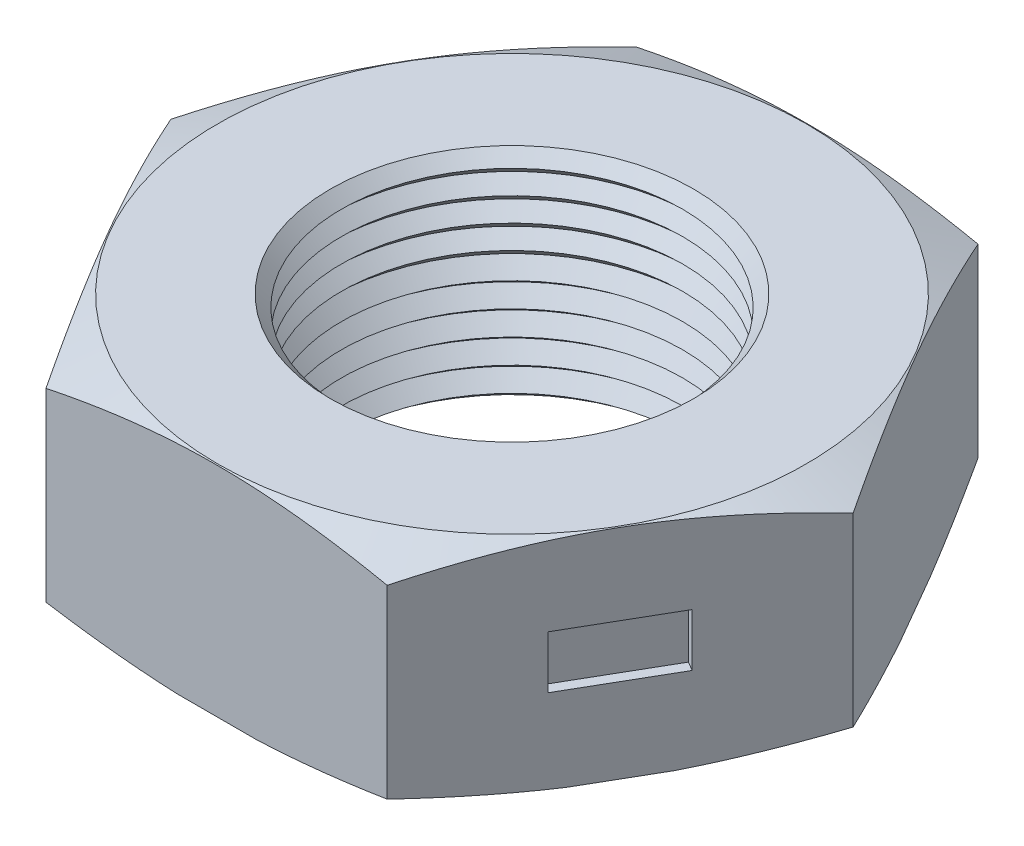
ISO-10303-21;
HEADER;
FILE_DESCRIPTION(('STEP AP214'),'2;1');
FILE_NAME('part.step','',(''),(''),'','','');
FILE_SCHEMA(('AUTOMOTIVE_DESIGN { 1 0 10303 214 1 1 1 1 }'));
ENDSEC;
DATA;
#1=APPLICATION_CONTEXT('core data for automotive mechanical design processes');
#2=APPLICATION_PROTOCOL_DEFINITION('international standard','automotive_design',2000,#1);
#3=PRODUCT_CONTEXT('',#1,'mechanical');
#4=PRODUCT('Part','Part','',(#3));
#5=PRODUCT_RELATED_PRODUCT_CATEGORY('part','',(#4));
#6=PRODUCT_DEFINITION_FORMATION('','',#4);
#7=PRODUCT_DEFINITION_CONTEXT('part definition',#1,'design');
#8=PRODUCT_DEFINITION('design','',#6,#7);
#9=PRODUCT_DEFINITION_SHAPE('','',#8);
#10=(LENGTH_UNIT() NAMED_UNIT(*) SI_UNIT(.MILLI.,.METRE.));
#11=(NAMED_UNIT(*) PLANE_ANGLE_UNIT() SI_UNIT($,.RADIAN.));
#12=(NAMED_UNIT(*) SI_UNIT($,.STERADIAN.) SOLID_ANGLE_UNIT());
#13=UNCERTAINTY_MEASURE_WITH_UNIT(LENGTH_MEASURE(1.E-05),#10,'distance_accuracy_value','');
#14=(GEOMETRIC_REPRESENTATION_CONTEXT(3) GLOBAL_UNCERTAINTY_ASSIGNED_CONTEXT((#13)) GLOBAL_UNIT_ASSIGNED_CONTEXT((#10,
#11,#12)) REPRESENTATION_CONTEXT('',''));
#15=CARTESIAN_POINT('',(0.,0.,0.));
#16=DIRECTION('',(0.,0.,1.));
#17=DIRECTION('',(1.,0.,0.));
#18=AXIS2_PLACEMENT_3D('',#15,#16,#17);
#19=CARTESIAN_POINT('',(0.,2.99369140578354,0.));
#20=DIRECTION('',(0.,-1.,0.));
#21=DIRECTION('',(0.,0.,-1.));
#22=AXIS2_PLACEMENT_3D('',#19,#20,#21);
#23=CONICAL_SURFACE('',#22,4.3908360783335,0.820157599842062);
#24=CARTESIAN_POINT('',(0.,2.99369137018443,0.));
#25=DIRECTION('',(0.,1.,0.));
#26=DIRECTION('',(0.,0.,1.));
#27=AXIS2_PLACEMENT_3D('',#24,#25,#26);
#28=CIRCLE('',#27,4.39083608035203);
#29=CARTESIAN_POINT('',(0.,2.99369137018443,4.39083608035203));
#30=VERTEX_POINT('',#29);
#31=EDGE_CURVE('E291',#30,#30,#28,.F.);
#32=ORIENTED_EDGE('',*,*,#31,.T.);
#33=EDGE_LOOP('',(#32));
#34=FACE_BOUND('',#33,.T.);
#35=CARTESIAN_POINT('',(0.,3.25927628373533,0.));
#36=DIRECTION('',(0.,1.,0.));
#37=DIRECTION('',(0.,0.,1.));
#38=AXIS2_PLACEMENT_3D('',#35,#36,#37);
#39=CIRCLE('',#38,4.10611513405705);
#40=CARTESIAN_POINT('',(0.,3.25927628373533,4.10611513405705));
#41=VERTEX_POINT('',#40);
#42=EDGE_CURVE('E296',#41,#41,#39,.T.);
#43=ORIENTED_EDGE('',*,*,#42,.T.);
#44=EDGE_LOOP('',(#43));
#45=FACE_BOUND('',#44,.T.);
#46=ADVANCED_FACE('F16',(#34,#45),#23,.F.);
#47=CARTESIAN_POINT('',(0.,3.56451205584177,0.));
#48=DIRECTION('',(0.,1.,0.));
#49=DIRECTION('',(-1.,0.,0.));
#50=AXIS2_PLACEMENT_3D('',#47,#48,#49);
#51=CONICAL_SURFACE('',#50,4.39083607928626,0.750638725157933);
#52=CARTESIAN_POINT('',(0.,3.56451209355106,0.));
#53=DIRECTION('',(0.,-1.,0.));
#54=DIRECTION('',(0.,0.,-1.));
#55=AXIS2_PLACEMENT_3D('',#52,#53,#54);
#56=CIRCLE('',#55,4.39083607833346);
#57=CARTESIAN_POINT('',(0.,3.56451209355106,-4.39083607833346));
#58=VERTEX_POINT('',#57);
#59=EDGE_CURVE('E286',#58,#58,#56,.F.);
#60=ORIENTED_EDGE('',*,*,#59,.T.);
#61=EDGE_LOOP('',(#60));
#62=FACE_BOUND('',#61,.T.);
#63=ORIENTED_EDGE('',*,*,#42,.F.);
#64=EDGE_LOOP('',(#63));
#65=FACE_BOUND('',#64,.T.);
#66=ADVANCED_FACE('F617',(#62,#65),#51,.F.);
#67=CARTESIAN_POINT('',(0.,2.99369137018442,0.));
#68=DIRECTION('',(0.,1.,0.));
#69=DIRECTION('',(-1.,0.,0.));
#70=AXIS2_PLACEMENT_3D('',#67,#68,#69);
#71=CONICAL_SURFACE('',#70,4.39083608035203,0.662739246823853);
#72=ORIENTED_EDGE('',*,*,#31,.F.);
#73=EDGE_LOOP('',(#72));
#74=FACE_BOUND('',#73,.T.);
#75=CARTESIAN_POINT('',(0.,2.62890002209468,0.));
#76=DIRECTION('',(0.,-1.,0.));
#77=DIRECTION('',(0.,0.,-1.));
#78=AXIS2_PLACEMENT_3D('',#75,#76,#77);
#79=CIRCLE('',#78,4.10611513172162);
#80=CARTESIAN_POINT('',(0.,2.62890002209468,-4.10611513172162));
#81=VERTEX_POINT('',#80);
#82=EDGE_CURVE('E281',#81,#81,#79,.T.);
#83=ORIENTED_EDGE('',*,*,#82,.T.);
#84=EDGE_LOOP('',(#83));
#85=FACE_BOUND('',#84,.T.);
#86=ADVANCED_FACE('F614',(#74,#85),#71,.F.);
#87=CARTESIAN_POINT('',(0.,3.56451209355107,0.));
#88=DIRECTION('',(0.,-1.,0.));
#89=DIRECTION('',(1.,0.,0.));
#90=AXIS2_PLACEMENT_3D('',#87,#88,#89);
#91=CONICAL_SURFACE('',#90,4.39083607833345,0.820157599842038);
#92=ORIENTED_EDGE('',*,*,#59,.F.);
#93=EDGE_LOOP('',(#92));
#94=FACE_BOUND('',#93,.T.);
#95=CARTESIAN_POINT('',(0.,3.83009697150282,0.));
#96=DIRECTION('',(0.,1.,0.));
#97=DIRECTION('',(0.,0.,1.));
#98=AXIS2_PLACEMENT_3D('',#95,#96,#97);
#99=CIRCLE('',#98,4.10611513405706);
#100=CARTESIAN_POINT('',(0.,3.83009697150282,4.10611513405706));
#101=VERTEX_POINT('',#100);
#102=EDGE_CURVE('E276',#101,#101,#99,.T.);
#103=ORIENTED_EDGE('',*,*,#102,.T.);
#104=EDGE_LOOP('',(#103));
#105=FACE_BOUND('',#104,.T.);
#106=ADVANCED_FACE('F610',(#94,#105),#91,.F.);
#107=CARTESIAN_POINT('',(0.,2.40667433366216,0.));
#108=DIRECTION('',(0.,-1.,0.));
#109=DIRECTION('',(0.,0.,-1.));
#110=AXIS2_PLACEMENT_3D('',#107,#108,#109);
#111=CONICAL_SURFACE('',#110,4.39083607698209,0.908057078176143);
#112=CARTESIAN_POINT('',(0.,2.40667429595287,0.));
#113=DIRECTION('',(0.,1.,0.));
#114=DIRECTION('',(0.,0.,1.));
#115=AXIS2_PLACEMENT_3D('',#112,#113,#114);
#116=CIRCLE('',#115,4.39083608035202);
#117=CARTESIAN_POINT('',(0.,2.40667429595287,4.39083608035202));
#118=VERTEX_POINT('',#117);
#119=EDGE_CURVE('E271',#118,#118,#116,.F.);
#120=ORIENTED_EDGE('',*,*,#119,.T.);
#121=EDGE_LOOP('',(#120));
#122=FACE_BOUND('',#121,.T.);
#123=ORIENTED_EDGE('',*,*,#82,.F.);
#124=EDGE_LOOP('',(#123));
#125=FACE_BOUND('',#124,.T.);
#126=ADVANCED_FACE('F606',(#122,#125),#111,.F.);
#127=CARTESIAN_POINT('',(0.,4.1353327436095,0.));
#128=DIRECTION('',(0.,1.,0.));
#129=DIRECTION('',(0.,0.,1.));
#130=AXIS2_PLACEMENT_3D('',#127,#128,#129);
#131=CONICAL_SURFACE('',#130,4.39083607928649,0.750638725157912);
#132=CARTESIAN_POINT('',(0.,4.13533278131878,0.));
#133=DIRECTION('',(0.,-1.,0.));
#134=DIRECTION('',(0.,0.,-1.));
#135=AXIS2_PLACEMENT_3D('',#132,#133,#134);
#136=CIRCLE('',#135,4.39083607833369);
#137=CARTESIAN_POINT('',(0.,4.13533278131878,-4.39083607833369));
#138=VERTEX_POINT('',#137);
#139=EDGE_CURVE('E266',#138,#138,#136,.F.);
#140=ORIENTED_EDGE('',*,*,#139,.T.);
#141=EDGE_LOOP('',(#140));
#142=FACE_BOUND('',#141,.T.);
#143=ORIENTED_EDGE('',*,*,#102,.F.);
#144=EDGE_LOOP('',(#143));
#145=FACE_BOUND('',#144,.T.);
#146=ADVANCED_FACE('F602',(#142,#145),#131,.F.);
#147=CARTESIAN_POINT('',(0.,2.40667429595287,0.));
#148=DIRECTION('',(0.,1.,0.));
#149=DIRECTION('',(0.,0.,1.));
#150=AXIS2_PLACEMENT_3D('',#147,#148,#149);
#151=CONICAL_SURFACE('',#150,4.39083608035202,0.662739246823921);
#152=ORIENTED_EDGE('',*,*,#119,.F.);
#153=EDGE_LOOP('',(#152));
#154=FACE_BOUND('',#153,.T.);
#155=CARTESIAN_POINT('',(0.,2.04188294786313,0.));
#156=DIRECTION('',(0.,-1.,0.));
#157=DIRECTION('',(0.,0.,-1.));
#158=AXIS2_PLACEMENT_3D('',#155,#156,#157);
#159=CIRCLE('',#158,4.10611513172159);
#160=CARTESIAN_POINT('',(0.,2.04188294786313,-4.10611513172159));
#161=VERTEX_POINT('',#160);
#162=EDGE_CURVE('E261',#161,#161,#159,.T.);
#163=ORIENTED_EDGE('',*,*,#162,.T.);
#164=EDGE_LOOP('',(#163));
#165=FACE_BOUND('',#164,.T.);
#166=ADVANCED_FACE('F598',(#154,#165),#151,.F.);
#167=CARTESIAN_POINT('',(0.,4.13533278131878,0.));
#168=DIRECTION('',(0.,-1.,0.));
#169=DIRECTION('',(0.,0.,-1.));
#170=AXIS2_PLACEMENT_3D('',#167,#168,#169);
#171=CONICAL_SURFACE('',#170,4.39083607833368,0.820157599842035);
#172=ORIENTED_EDGE('',*,*,#139,.F.);
#173=EDGE_LOOP('',(#172));
#174=FACE_BOUND('',#173,.T.);
#175=CARTESIAN_POINT('',(0.,4.40091765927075,0.));
#176=DIRECTION('',(0.,1.,0.));
#177=DIRECTION('',(0.,0.,1.));
#178=AXIS2_PLACEMENT_3D('',#175,#176,#177);
#179=CIRCLE('',#178,4.10611513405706);
#180=CARTESIAN_POINT('',(0.,4.40091765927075,4.10611513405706));
#181=VERTEX_POINT('',#180);
#182=EDGE_CURVE('E256',#181,#181,#179,.T.);
#183=ORIENTED_EDGE('',*,*,#182,.T.);
#184=EDGE_LOOP('',(#183));
#185=FACE_BOUND('',#184,.T.);
#186=ADVANCED_FACE('F594',(#174,#185),#171,.F.);
#187=CARTESIAN_POINT('',(0.,1.81965725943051,0.));
#188=DIRECTION('',(0.,-1.,0.));
#189=DIRECTION('',(0.,0.,-1.));
#190=AXIS2_PLACEMENT_3D('',#187,#188,#189);
#191=CONICAL_SURFACE('',#190,4.39083607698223,0.908057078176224);
#192=CARTESIAN_POINT('',(0.,1.81965722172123,0.));
#193=DIRECTION('',(0.,1.,0.));
#194=DIRECTION('',(0.,0.,1.));
#195=AXIS2_PLACEMENT_3D('',#192,#193,#194);
#196=CIRCLE('',#195,4.39083608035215);
#197=CARTESIAN_POINT('',(0.,1.81965722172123,4.39083608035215));
#198=VERTEX_POINT('',#197);
#199=EDGE_CURVE('E251',#198,#198,#196,.F.);
#200=ORIENTED_EDGE('',*,*,#199,.T.);
#201=EDGE_LOOP('',(#200));
#202=FACE_BOUND('',#201,.T.);
#203=ORIENTED_EDGE('',*,*,#162,.F.);
#204=EDGE_LOOP('',(#203));
#205=FACE_BOUND('',#204,.T.);
#206=ADVANCED_FACE('F590',(#202,#205),#191,.F.);
#207=CARTESIAN_POINT('',(0.,4.70615343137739,0.));
#208=DIRECTION('',(0.,1.,0.));
#209=DIRECTION('',(0.,0.,1.));
#210=AXIS2_PLACEMENT_3D('',#207,#208,#209);
#211=CONICAL_SURFACE('',#210,4.39083607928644,0.750638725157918);
#212=CARTESIAN_POINT('',(0.,4.70615346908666,0.));
#213=DIRECTION('',(0.,-1.,0.));
#214=DIRECTION('',(0.,0.,-1.));
#215=AXIS2_PLACEMENT_3D('',#212,#213,#214);
#216=CIRCLE('',#215,4.39083607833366);
#217=CARTESIAN_POINT('',(0.,4.70615346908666,-4.39083607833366));
#218=VERTEX_POINT('',#217);
#219=EDGE_CURVE('E246',#218,#218,#216,.F.);
#220=ORIENTED_EDGE('',*,*,#219,.T.);
#221=EDGE_LOOP('',(#220));
#222=FACE_BOUND('',#221,.T.);
#223=ORIENTED_EDGE('',*,*,#182,.F.);
#224=EDGE_LOOP('',(#223));
#225=FACE_BOUND('',#224,.T.);
#226=ADVANCED_FACE('F586',(#222,#225),#211,.F.);
#227=CARTESIAN_POINT('',(0.,1.81965722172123,0.));
#228=DIRECTION('',(0.,1.,0.));
#229=DIRECTION('',(0.,0.,1.));
#230=AXIS2_PLACEMENT_3D('',#227,#228,#229);
#231=CONICAL_SURFACE('',#230,4.39083608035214,0.662739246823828);
#232=ORIENTED_EDGE('',*,*,#199,.F.);
#233=EDGE_LOOP('',(#232));
#234=FACE_BOUND('',#233,.T.);
#235=CARTESIAN_POINT('',(0.,1.45486587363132,0.));
#236=DIRECTION('',(0.,-1.,0.));
#237=DIRECTION('',(0.,0.,-1.));
#238=AXIS2_PLACEMENT_3D('',#235,#236,#237);
#239=CIRCLE('',#238,4.10611513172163);
#240=CARTESIAN_POINT('',(0.,1.45486587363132,-4.10611513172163));
#241=VERTEX_POINT('',#240);
#242=EDGE_CURVE('E241',#241,#241,#239,.T.);
#243=ORIENTED_EDGE('',*,*,#242,.T.);
#244=EDGE_LOOP('',(#243));
#245=FACE_BOUND('',#244,.T.);
#246=ADVANCED_FACE('F582',(#234,#245),#231,.F.);
#247=CARTESIAN_POINT('',(0.,4.70615346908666,0.));
#248=DIRECTION('',(0.,-1.,0.));
#249=DIRECTION('',(0.,0.,-1.));
#250=AXIS2_PLACEMENT_3D('',#247,#248,#249);
#251=CONICAL_SURFACE('',#250,4.39083607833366,0.820157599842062);
#252=ORIENTED_EDGE('',*,*,#219,.F.);
#253=EDGE_LOOP('',(#252));
#254=FACE_BOUND('',#253,.T.);
#255=CARTESIAN_POINT('',(0.,4.9717383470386,0.));
#256=DIRECTION('',(0.,1.,0.));
#257=DIRECTION('',(0.,0.,1.));
#258=AXIS2_PLACEMENT_3D('',#255,#256,#257);
#259=CIRCLE('',#258,4.10611513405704);
#260=CARTESIAN_POINT('',(0.,4.9717383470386,4.10611513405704));
#261=VERTEX_POINT('',#260);
#262=EDGE_CURVE('E236',#261,#261,#259,.T.);
#263=ORIENTED_EDGE('',*,*,#262,.T.);
#264=EDGE_LOOP('',(#263));
#265=FACE_BOUND('',#264,.T.);
#266=ADVANCED_FACE('F578',(#254,#265),#251,.F.);
#267=CARTESIAN_POINT('',(0.,1.2326401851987,0.));
#268=DIRECTION('',(0.,-1.,0.));
#269=DIRECTION('',(0.,0.,-1.));
#270=AXIS2_PLACEMENT_3D('',#267,#268,#269);
#271=CONICAL_SURFACE('',#270,4.39083607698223,0.908057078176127);
#272=CARTESIAN_POINT('',(0.,1.23264014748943,0.));
#273=DIRECTION('',(0.,1.,0.));
#274=DIRECTION('',(0.,0.,1.));
#275=AXIS2_PLACEMENT_3D('',#272,#273,#274);
#276=CIRCLE('',#275,4.39083608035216);
#277=CARTESIAN_POINT('',(0.,1.23264014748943,4.39083608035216));
#278=VERTEX_POINT('',#277);
#279=EDGE_CURVE('E233',#278,#278,#276,.F.);
#280=ORIENTED_EDGE('',*,*,#279,.T.);
#281=EDGE_LOOP('',(#280));
#282=FACE_BOUND('',#281,.T.);
#283=ORIENTED_EDGE('',*,*,#242,.F.);
#284=EDGE_LOOP('',(#283));
#285=FACE_BOUND('',#284,.T.);
#286=ADVANCED_FACE('F570',(#282,#285),#271,.F.);
#287=CARTESIAN_POINT('',(0.,5.25779998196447,0.));
#288=DIRECTION('',(0.,1.,0.));
#289=DIRECTION('',(0.,0.,1.));
#290=AXIS2_PLACEMENT_3D('',#287,#288,#289);
#291=CONICAL_SURFACE('',#290,4.37295063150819,0.750638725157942);
#292=CARTESIAN_POINT('',(0.,5.25779998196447,0.));
#293=DIRECTION('',(0.,1.,0.));
#294=DIRECTION('',(0.,0.,1.));
#295=AXIS2_PLACEMENT_3D('',#292,#293,#294);
#296=CIRCLE('',#295,4.37295063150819);
#297=CARTESIAN_POINT('',(0.,5.25779998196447,4.37295063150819));
#298=VERTEX_POINT('',#297);
#299=EDGE_CURVE('E19',#298,#298,#296,.T.);
#300=ORIENTED_EDGE('',*,*,#299,.T.);
#301=EDGE_LOOP('',(#300));
#302=FACE_BOUND('',#301,.T.);
#303=ORIENTED_EDGE('',*,*,#262,.F.);
#304=EDGE_LOOP('',(#303));
#305=FACE_BOUND('',#304,.T.);
#306=ADVANCED_FACE('F560',(#302,#305),#291,.F.);
#307=CARTESIAN_POINT('',(0.,1.23264014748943,0.));
#308=DIRECTION('',(0.,1.,0.));
#309=DIRECTION('',(0.,0.,1.));
#310=AXIS2_PLACEMENT_3D('',#307,#308,#309);
#311=CONICAL_SURFACE('',#310,4.39083608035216,0.66273924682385);
#312=ORIENTED_EDGE('',*,*,#279,.F.);
#313=EDGE_LOOP('',(#312));
#314=FACE_BOUND('',#313,.T.);
#315=CARTESIAN_POINT('',(0.,0.867848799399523,0.));
#316=DIRECTION('',(0.,-1.,0.));
#317=DIRECTION('',(0.,0.,-1.));
#318=AXIS2_PLACEMENT_3D('',#315,#316,#317);
#319=CIRCLE('',#318,4.10611513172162);
#320=CARTESIAN_POINT('',(0.,0.867848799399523,-4.10611513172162));
#321=VERTEX_POINT('',#320);
#322=EDGE_CURVE('E228',#321,#321,#319,.T.);
#323=ORIENTED_EDGE('',*,*,#322,.T.);
#324=EDGE_LOOP('',(#323));
#325=FACE_BOUND('',#324,.T.);
#326=ADVANCED_FACE('F557',(#314,#325),#311,.F.);
#327=CARTESIAN_POINT('',(1.27,2.07357831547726,-6.858));
#328=DIRECTION('',(0.,0.,-1.));
#329=DIRECTION('',(-1.,0.,0.));
#330=AXIS2_PLACEMENT_3D('',#327,#328,#329);
#331=PLANE('',#330);
#332=DIRECTION('',(0.,1.,0.));
#333=VECTOR('',#332,1.);
#334=CARTESIAN_POINT('',(-1.27,3.34357831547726,-6.858));
#335=LINE('',#334,#333);
#336=CARTESIAN_POINT('',(-1.27,2.07357831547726,-6.858));
#337=VERTEX_POINT('',#336);
#338=CARTESIAN_POINT('',(-1.27,3.34357831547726,-6.858));
#339=VERTEX_POINT('',#338);
#340=EDGE_CURVE('E216',#337,#339,#335,.T.);
#341=ORIENTED_EDGE('',*,*,#340,.T.);
#342=DIRECTION('',(1.,0.,0.));
#343=VECTOR('',#342,1.);
#344=CARTESIAN_POINT('',(1.27,3.34357831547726,-6.858));
#345=LINE('',#344,#343);
#346=CARTESIAN_POINT('',(1.27,3.34357831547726,-6.858));
#347=VERTEX_POINT('',#346);
#348=EDGE_CURVE('E222',#339,#347,#345,.T.);
#349=ORIENTED_EDGE('',*,*,#348,.T.);
#350=DIRECTION('',(0.,1.,0.));
#351=VECTOR('',#350,1.);
#352=CARTESIAN_POINT('',(1.27,3.34357831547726,-6.858));
#353=LINE('',#352,#351);
#354=CARTESIAN_POINT('',(1.27,2.07357831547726,-6.858));
#355=VERTEX_POINT('',#354);
#356=EDGE_CURVE('E225',#347,#355,#353,.F.);
#357=ORIENTED_EDGE('',*,*,#356,.T.);
#358=DIRECTION('',(1.,0.,0.));
#359=VECTOR('',#358,1.);
#360=CARTESIAN_POINT('',(1.27,2.07357831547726,-6.858));
#361=LINE('',#360,#359);
#362=EDGE_CURVE('E207',#355,#337,#361,.F.);
#363=ORIENTED_EDGE('',*,*,#362,.T.);
#364=EDGE_LOOP('',(#341,#349,#357,#363));
#365=FACE_BOUND('',#364,.T.);
#366=ADVANCED_FACE('F559',(#365),#331,.T.);
#367=CARTESIAN_POINT('',(5.3042022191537,2.032,4.52885226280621));
#368=DIRECTION('',(0.86602540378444,0.,0.499999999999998));
#369=DIRECTION('',(0.499999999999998,0.,-0.86602540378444));
#370=AXIS2_PLACEMENT_3D('',#367,#368,#369);
#371=PLANE('',#370);
#372=DIRECTION('',(0.,1.,0.));
#373=VECTOR('',#372,1.);
#374=CARTESIAN_POINT('',(6.57420221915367,3.302,2.32914773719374));
#375=LINE('',#374,#373);
#376=CARTESIAN_POINT('',(6.57420221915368,2.032,2.32914773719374));
#377=VERTEX_POINT('',#376);
#378=CARTESIAN_POINT('',(6.57420221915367,3.302,2.32914773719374));
#379=VERTEX_POINT('',#378);
#380=EDGE_CURVE('E201',#377,#379,#375,.T.);
#381=ORIENTED_EDGE('',*,*,#380,.T.);
#382=DIRECTION('',(-0.499999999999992,0.,0.866025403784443));
#383=VECTOR('',#382,1.);
#384=CARTESIAN_POINT('',(6.57420221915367,3.302,2.32914773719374));
#385=LINE('',#384,#383);
#386=CARTESIAN_POINT('',(5.3042022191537,3.302,4.52885226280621));
#387=VERTEX_POINT('',#386);
#388=EDGE_CURVE('E195',#379,#387,#385,.T.);
#389=ORIENTED_EDGE('',*,*,#388,.T.);
#390=DIRECTION('',(0.,1.,0.));
#391=VECTOR('',#390,1.);
#392=CARTESIAN_POINT('',(5.3042022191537,3.302,4.52885226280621));
#393=LINE('',#392,#391);
#394=CARTESIAN_POINT('',(5.3042022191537,2.032,4.52885226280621));
#395=VERTEX_POINT('',#394);
#396=EDGE_CURVE('E189',#387,#395,#393,.F.);
#397=ORIENTED_EDGE('',*,*,#396,.T.);
#398=DIRECTION('',(0.499999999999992,0.,-0.866025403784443));
#399=VECTOR('',#398,1.);
#400=CARTESIAN_POINT('',(5.3042022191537,2.032,4.52885226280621));
#401=LINE('',#400,#399);
#402=EDGE_CURVE('E183',#395,#377,#401,.T.);
#403=ORIENTED_EDGE('',*,*,#402,.T.);
#404=EDGE_LOOP('',(#381,#389,#397,#403));
#405=FACE_BOUND('',#404,.T.);
#406=ADVANCED_FACE('F567',(#405),#371,.T.);
#407=CARTESIAN_POINT('',(-6.57420221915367,2.032,2.32914773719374));
#408=DIRECTION('',(-0.86602540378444,0.,0.499999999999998));
#409=DIRECTION('',(0.499999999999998,0.,0.86602540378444));
#410=AXIS2_PLACEMENT_3D('',#407,#408,#409);
#411=PLANE('',#410);
#412=DIRECTION('',(0.,1.,0.));
#413=VECTOR('',#412,1.);
#414=CARTESIAN_POINT('',(-5.3042022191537,3.302,4.52885226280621));
#415=LINE('',#414,#413);
#416=CARTESIAN_POINT('',(-5.30420221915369,2.032,4.52885226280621));
#417=VERTEX_POINT('',#416);
#418=CARTESIAN_POINT('',(-5.30420221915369,3.302,4.52885226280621));
#419=VERTEX_POINT('',#418);
#420=EDGE_CURVE('E168',#417,#419,#415,.T.);
#421=ORIENTED_EDGE('',*,*,#420,.T.);
#422=DIRECTION('',(-0.499999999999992,0.,-0.866025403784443));
#423=VECTOR('',#422,1.);
#424=CARTESIAN_POINT('',(-5.3042022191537,3.302,4.52885226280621));
#425=LINE('',#424,#423);
#426=CARTESIAN_POINT('',(-6.57420221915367,3.302,2.32914773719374));
#427=VERTEX_POINT('',#426);
#428=EDGE_CURVE('E174',#419,#427,#425,.T.);
#429=ORIENTED_EDGE('',*,*,#428,.T.);
#430=DIRECTION('',(0.,1.,0.));
#431=VECTOR('',#430,1.);
#432=CARTESIAN_POINT('',(-6.57420221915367,3.302,2.32914773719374));
#433=LINE('',#432,#431);
#434=CARTESIAN_POINT('',(-6.57420221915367,2.032,2.32914773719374));
#435=VERTEX_POINT('',#434);
#436=EDGE_CURVE('E177',#427,#435,#433,.F.);
#437=ORIENTED_EDGE('',*,*,#436,.T.);
#438=DIRECTION('',(0.499999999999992,0.,0.866025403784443));
#439=VECTOR('',#438,1.);
#440=CARTESIAN_POINT('',(-6.57420221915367,2.032,2.32914773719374));
#441=LINE('',#440,#439);
#442=EDGE_CURVE('E159',#435,#417,#441,.T.);
#443=ORIENTED_EDGE('',*,*,#442,.T.);
#444=EDGE_LOOP('',(#421,#429,#437,#443));
#445=FACE_BOUND('',#444,.T.);
#446=ADVANCED_FACE('F706',(#445),#411,.T.);
#447=CARTESIAN_POINT('',(-12.3183453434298,5.2578,-7.112));
#448=DIRECTION('',(0.,-1.,0.));
#449=DIRECTION('',(0.,0.,-1.));
#450=AXIS2_PLACEMENT_3D('',#447,#448,#449);
#451=PLANE('',#450);
#452=ORIENTED_EDGE('',*,*,#299,.F.);
#453=EDGE_LOOP('',(#452));
#454=FACE_BOUND('',#453,.T.);
#455=CARTESIAN_POINT('',(0.,5.25780002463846,0.));
#456=DIRECTION('',(0.,-1.,0.));
#457=DIRECTION('',(0.,0.,-1.));
#458=AXIS2_PLACEMENT_3D('',#455,#456,#457);
#459=CIRCLE('',#458,7.08837121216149);
#460=CARTESIAN_POINT('',(0.,5.25780002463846,-7.08837121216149));
#461=VERTEX_POINT('',#460);
#462=EDGE_CURVE('E153',#461,#461,#459,.T.);
#463=ORIENTED_EDGE('',*,*,#462,.F.);
#464=EDGE_LOOP('',(#463));
#465=FACE_BOUND('',#464,.T.);
#466=ADVANCED_FACE('F553',(#454,#465),#451,.F.);
#467=CARTESIAN_POINT('',(0.,0.645623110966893,0.));
#468=DIRECTION('',(0.,-1.,0.));
#469=DIRECTION('',(0.,0.,-1.));
#470=AXIS2_PLACEMENT_3D('',#467,#468,#469);
#471=CONICAL_SURFACE('',#470,4.39083607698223,0.908057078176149);
#472=CARTESIAN_POINT('',(0.,0.64562307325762,0.));
#473=DIRECTION('',(0.,1.,0.));
#474=DIRECTION('',(0.,0.,1.));
#475=AXIS2_PLACEMENT_3D('',#472,#473,#474);
#476=CIRCLE('',#475,4.39083608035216);
#477=CARTESIAN_POINT('',(0.,0.64562307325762,4.39083608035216));
#478=VERTEX_POINT('',#477);
#479=EDGE_CURVE('E118',#478,#478,#476,.F.);
#480=ORIENTED_EDGE('',*,*,#479,.T.);
#481=EDGE_LOOP('',(#480));
#482=FACE_BOUND('',#481,.T.);
#483=ORIENTED_EDGE('',*,*,#322,.F.);
#484=EDGE_LOOP('',(#483));
#485=FACE_BOUND('',#484,.T.);
#486=ADVANCED_FACE('F549',(#482,#485),#471,.F.);
#487=CARTESIAN_POINT('',(1.27,3.34357831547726,-6.858));
#488=DIRECTION('',(1.,0.,0.));
#489=DIRECTION('',(0.,0.,-1.));
#490=AXIS2_PLACEMENT_3D('',#487,#488,#489);
#491=PLANE('',#490);
#492=DIRECTION('',(0.,0.,-1.));
#493=VECTOR('',#492,1.);
#494=CARTESIAN_POINT('',(1.27,2.07357831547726,-6.858));
#495=LINE('',#494,#493);
#496=CARTESIAN_POINT('',(1.27,2.07357831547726,-7.112));
#497=VERTEX_POINT('',#496);
#498=EDGE_CURVE('E210',#497,#355,#495,.F.);
#499=ORIENTED_EDGE('',*,*,#498,.T.);
#500=ORIENTED_EDGE('',*,*,#356,.F.);
#501=DIRECTION('',(0.,0.,1.));
#502=VECTOR('',#501,1.);
#503=CARTESIAN_POINT('',(1.27,3.34357831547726,-6.858));
#504=LINE('',#503,#502);
#505=CARTESIAN_POINT('',(1.27,3.34357831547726,-7.112));
#506=VERTEX_POINT('',#505);
#507=EDGE_CURVE('E219',#347,#506,#504,.F.);
#508=ORIENTED_EDGE('',*,*,#507,.T.);
#509=DIRECTION('',(0.,1.,0.));
#510=VECTOR('',#509,1.);
#511=CARTESIAN_POINT('',(1.27,5.2578,-7.112));
#512=LINE('',#511,#510);
#513=EDGE_CURVE('E117',#497,#506,#512,.T.);
#514=ORIENTED_EDGE('',*,*,#513,.F.);
#515=EDGE_LOOP('',(#499,#500,#508,#514));
#516=FACE_BOUND('',#515,.T.);
#517=ADVANCED_FACE('F552',(#516),#491,.F.);
#518=CARTESIAN_POINT('',(1.27,3.34357831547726,-6.858));
#519=DIRECTION('',(0.,1.,0.));
#520=DIRECTION('',(0.,0.,1.));
#521=AXIS2_PLACEMENT_3D('',#518,#519,#520);
#522=PLANE('',#521);
#523=ORIENTED_EDGE('',*,*,#507,.F.);
#524=ORIENTED_EDGE('',*,*,#348,.F.);
#525=DIRECTION('',(0.,0.,1.));
#526=VECTOR('',#525,1.);
#527=CARTESIAN_POINT('',(-1.27,3.34357831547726,-6.858));
#528=LINE('',#527,#526);
#529=CARTESIAN_POINT('',(-1.27,3.34357831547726,-7.112));
#530=VERTEX_POINT('',#529);
#531=EDGE_CURVE('E213',#339,#530,#528,.F.);
#532=ORIENTED_EDGE('',*,*,#531,.T.);
#533=DIRECTION('',(-1.,0.,0.));
#534=VECTOR('',#533,1.);
#535=CARTESIAN_POINT('',(-4.10611511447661,3.34357831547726,-7.112));
#536=LINE('',#535,#534);
#537=EDGE_CURVE('E146',#506,#530,#536,.T.);
#538=ORIENTED_EDGE('',*,*,#537,.F.);
#539=EDGE_LOOP('',(#523,#524,#532,#538));
#540=FACE_BOUND('',#539,.T.);
#541=ADVANCED_FACE('F731',(#540),#522,.F.);
#542=CARTESIAN_POINT('',(-1.27,3.34357831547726,-6.858));
#543=DIRECTION('',(-1.,0.,0.));
#544=DIRECTION('',(0.,0.,1.));
#545=AXIS2_PLACEMENT_3D('',#542,#543,#544);
#546=PLANE('',#545);
#547=ORIENTED_EDGE('',*,*,#531,.F.);
#548=ORIENTED_EDGE('',*,*,#340,.F.);
#549=DIRECTION('',(0.,0.,-1.));
#550=VECTOR('',#549,1.);
#551=CARTESIAN_POINT('',(-1.27,2.07357831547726,-6.858));
#552=LINE('',#551,#550);
#553=CARTESIAN_POINT('',(-1.27,2.07357831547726,-7.112));
#554=VERTEX_POINT('',#553);
#555=EDGE_CURVE('E204',#337,#554,#552,.T.);
#556=ORIENTED_EDGE('',*,*,#555,.T.);
#557=DIRECTION('',(0.,1.,0.));
#558=VECTOR('',#557,1.);
#559=CARTESIAN_POINT('',(-1.27,5.2578,-7.112));
#560=LINE('',#559,#558);
#561=EDGE_CURVE('E143',#530,#554,#560,.F.);
#562=ORIENTED_EDGE('',*,*,#561,.F.);
#563=EDGE_LOOP('',(#547,#548,#556,#562));
#564=FACE_BOUND('',#563,.T.);
#565=ADVANCED_FACE('F739',(#564),#546,.F.);
#566=CARTESIAN_POINT('',(1.27,2.07357831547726,-6.858));
#567=DIRECTION('',(0.,-1.,0.));
#568=DIRECTION('',(0.,0.,-1.));
#569=AXIS2_PLACEMENT_3D('',#566,#567,#568);
#570=PLANE('',#569);
#571=ORIENTED_EDGE('',*,*,#555,.F.);
#572=ORIENTED_EDGE('',*,*,#362,.F.);
#573=ORIENTED_EDGE('',*,*,#498,.F.);
#574=DIRECTION('',(-1.,0.,0.));
#575=VECTOR('',#574,1.);
#576=CARTESIAN_POINT('',(-4.10611511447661,2.07357831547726,-7.112));
#577=LINE('',#576,#575);
#578=EDGE_CURVE('E140',#554,#497,#577,.F.);
#579=ORIENTED_EDGE('',*,*,#578,.F.);
#580=EDGE_LOOP('',(#571,#572,#573,#579));
#581=FACE_BOUND('',#580,.T.);
#582=ADVANCED_FACE('F747',(#581),#570,.F.);
#583=CARTESIAN_POINT('',(6.57420221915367,3.302,2.32914773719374));
#584=DIRECTION('',(0.499999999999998,0.,-0.86602540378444));
#585=DIRECTION('',(-0.86602540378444,0.,-0.499999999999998));
#586=AXIS2_PLACEMENT_3D('',#583,#584,#585);
#587=PLANE('',#586);
#588=DIRECTION('',(-0.866025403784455,0.,-0.499999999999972));
#589=VECTOR('',#588,1.);
#590=CARTESIAN_POINT('',(6.79417267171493,3.302,2.45614773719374));
#591=LINE('',#590,#589);
#592=CARTESIAN_POINT('',(6.79417267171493,3.302,2.45614773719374));
#593=VERTEX_POINT('',#592);
#594=EDGE_CURVE('E198',#593,#379,#591,.T.);
#595=ORIENTED_EDGE('',*,*,#594,.T.);
#596=ORIENTED_EDGE('',*,*,#380,.F.);
#597=DIRECTION('',(0.866025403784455,0.,0.499999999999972));
#598=VECTOR('',#597,1.);
#599=CARTESIAN_POINT('',(6.57420221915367,2.032,2.32914773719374));
#600=LINE('',#599,#598);
#601=CARTESIAN_POINT('',(6.79417267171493,2.032,2.45614773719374));
#602=VERTEX_POINT('',#601);
#603=EDGE_CURVE('E180',#377,#602,#600,.T.);
#604=ORIENTED_EDGE('',*,*,#603,.T.);
#605=DIRECTION('',(0.,1.,0.));
#606=VECTOR('',#605,1.);
#607=CARTESIAN_POINT('',(6.79417267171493,5.2578,2.45614773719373));
#608=LINE('',#607,#606);
#609=EDGE_CURVE('E444',#602,#593,#608,.T.);
#610=ORIENTED_EDGE('',*,*,#609,.T.);
#611=EDGE_LOOP('',(#595,#596,#604,#610));
#612=FACE_BOUND('',#611,.T.);
#613=ADVANCED_FACE('F755',(#612),#587,.F.);
#614=CARTESIAN_POINT('',(5.3042022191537,3.302,4.52885226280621));
#615=DIRECTION('',(0.,1.,0.));
#616=DIRECTION('',(0.,0.,1.));
#617=AXIS2_PLACEMENT_3D('',#614,#615,#616);
#618=PLANE('',#617);
#619=DIRECTION('',(0.86602540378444,0.,0.499999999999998));
#620=VECTOR('',#619,1.);
#621=CARTESIAN_POINT('',(5.3042022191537,3.302,4.52885226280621));
#622=LINE('',#621,#620);
#623=CARTESIAN_POINT('',(5.52417267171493,3.302,4.65585226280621));
#624=VERTEX_POINT('',#623);
#625=EDGE_CURVE('E192',#624,#387,#622,.F.);
#626=ORIENTED_EDGE('',*,*,#625,.T.);
#627=ORIENTED_EDGE('',*,*,#388,.F.);
#628=ORIENTED_EDGE('',*,*,#594,.F.);
#629=DIRECTION('',(-0.499999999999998,0.,0.86602540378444));
#630=VECTOR('',#629,1.);
#631=CARTESIAN_POINT('',(4.10611511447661,3.302,7.112));
#632=LINE('',#631,#630);
#633=EDGE_CURVE('E438',#593,#624,#632,.T.);
#634=ORIENTED_EDGE('',*,*,#633,.T.);
#635=EDGE_LOOP('',(#626,#627,#628,#634));
#636=FACE_BOUND('',#635,.T.);
#637=ADVANCED_FACE('F763',(#636),#618,.F.);
#638=CARTESIAN_POINT('',(5.3042022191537,3.302,4.52885226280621));
#639=DIRECTION('',(-0.499999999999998,0.,0.86602540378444));
#640=DIRECTION('',(0.86602540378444,0.,0.499999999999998));
#641=AXIS2_PLACEMENT_3D('',#638,#639,#640);
#642=PLANE('',#641);
#643=DIRECTION('',(-0.86602540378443,0.,-0.500000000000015));
#644=VECTOR('',#643,1.);
#645=CARTESIAN_POINT('',(5.52417267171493,2.032,4.65585226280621));
#646=LINE('',#645,#644);
#647=CARTESIAN_POINT('',(5.52417267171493,2.032,4.65585226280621));
#648=VERTEX_POINT('',#647);
#649=EDGE_CURVE('E186',#648,#395,#646,.T.);
#650=ORIENTED_EDGE('',*,*,#649,.T.);
#651=ORIENTED_EDGE('',*,*,#396,.F.);
#652=ORIENTED_EDGE('',*,*,#625,.F.);
#653=DIRECTION('',(0.,1.,0.));
#654=VECTOR('',#653,1.);
#655=CARTESIAN_POINT('',(5.52417267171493,5.2578,4.65585226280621));
#656=LINE('',#655,#654);
#657=EDGE_CURVE('E430',#624,#648,#656,.F.);
#658=ORIENTED_EDGE('',*,*,#657,.T.);
#659=EDGE_LOOP('',(#650,#651,#652,#658));
#660=FACE_BOUND('',#659,.T.);
#661=ADVANCED_FACE('F770',(#660),#642,.F.);
#662=CARTESIAN_POINT('',(5.3042022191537,2.032,4.52885226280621));
#663=DIRECTION('',(0.,-1.,0.));
#664=DIRECTION('',(0.,0.,-1.));
#665=AXIS2_PLACEMENT_3D('',#662,#663,#664);
#666=PLANE('',#665);
#667=ORIENTED_EDGE('',*,*,#603,.F.);
#668=ORIENTED_EDGE('',*,*,#402,.F.);
#669=ORIENTED_EDGE('',*,*,#649,.F.);
#670=DIRECTION('',(-0.499999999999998,0.,0.86602540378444));
#671=VECTOR('',#670,1.);
#672=CARTESIAN_POINT('',(4.10611511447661,2.032,7.112));
#673=LINE('',#672,#671);
#674=EDGE_CURVE('E424',#648,#602,#673,.F.);
#675=ORIENTED_EDGE('',*,*,#674,.T.);
#676=EDGE_LOOP('',(#667,#668,#669,#675));
#677=FACE_BOUND('',#676,.T.);
#678=ADVANCED_FACE('F778',(#677),#666,.F.);
#679=CARTESIAN_POINT('',(-6.57420221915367,3.302,2.32914773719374));
#680=DIRECTION('',(-0.499999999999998,0.,-0.86602540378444));
#681=DIRECTION('',(-0.86602540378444,0.,0.499999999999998));
#682=AXIS2_PLACEMENT_3D('',#679,#680,#681);
#683=PLANE('',#682);
#684=DIRECTION('',(0.866025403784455,0.,-0.499999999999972));
#685=VECTOR('',#684,1.);
#686=CARTESIAN_POINT('',(-6.79417267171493,2.032,2.45614773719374));
#687=LINE('',#686,#685);
#688=CARTESIAN_POINT('',(-6.79417267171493,2.032,2.45614773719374));
#689=VERTEX_POINT('',#688);
#690=EDGE_CURVE('E162',#689,#435,#687,.T.);
#691=ORIENTED_EDGE('',*,*,#690,.T.);
#692=ORIENTED_EDGE('',*,*,#436,.F.);
#693=DIRECTION('',(-0.866025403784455,0.,0.499999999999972));
#694=VECTOR('',#693,1.);
#695=CARTESIAN_POINT('',(-6.57420221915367,3.302,2.32914773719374));
#696=LINE('',#695,#694);
#697=CARTESIAN_POINT('',(-6.79417267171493,3.302,2.45614773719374));
#698=VERTEX_POINT('',#697);
#699=EDGE_CURVE('E171',#427,#698,#696,.T.);
#700=ORIENTED_EDGE('',*,*,#699,.T.);
#701=DIRECTION('',(0.,1.,0.));
#702=VECTOR('',#701,1.);
#703=CARTESIAN_POINT('',(-6.79417267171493,5.2578,2.45614773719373));
#704=LINE('',#703,#702);
#705=EDGE_CURVE('E485',#689,#698,#704,.T.);
#706=ORIENTED_EDGE('',*,*,#705,.F.);
#707=EDGE_LOOP('',(#691,#692,#700,#706));
#708=FACE_BOUND('',#707,.T.);
#709=ADVANCED_FACE('F786',(#708),#683,.F.);
#710=CARTESIAN_POINT('',(-6.57420221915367,3.302,2.32914773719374));
#711=DIRECTION('',(0.,1.,0.));
#712=DIRECTION('',(0.,0.,1.));
#713=AXIS2_PLACEMENT_3D('',#710,#711,#712);
#714=PLANE('',#713);
#715=ORIENTED_EDGE('',*,*,#699,.F.);
#716=ORIENTED_EDGE('',*,*,#428,.F.);
#717=DIRECTION('',(0.86602540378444,0.,-0.499999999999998));
#718=VECTOR('',#717,1.);
#719=CARTESIAN_POINT('',(-5.3042022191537,3.302,4.52885226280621));
#720=LINE('',#719,#718);
#721=CARTESIAN_POINT('',(-5.52417267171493,3.302,4.65585226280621));
#722=VERTEX_POINT('',#721);
#723=EDGE_CURVE('E165',#419,#722,#720,.F.);
#724=ORIENTED_EDGE('',*,*,#723,.T.);
#725=DIRECTION('',(0.499999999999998,0.,0.86602540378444));
#726=VECTOR('',#725,1.);
#727=CARTESIAN_POINT('',(-4.10611511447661,3.302,7.112));
#728=LINE('',#727,#726);
#729=EDGE_CURVE('E482',#698,#722,#728,.T.);
#730=ORIENTED_EDGE('',*,*,#729,.F.);
#731=EDGE_LOOP('',(#715,#716,#724,#730));
#732=FACE_BOUND('',#731,.T.);
#733=ADVANCED_FACE('F793',(#732),#714,.F.);
#734=CARTESIAN_POINT('',(-5.3042022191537,3.302,4.52885226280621));
#735=DIRECTION('',(0.499999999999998,0.,0.86602540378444));
#736=DIRECTION('',(0.86602540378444,0.,-0.499999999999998));
#737=AXIS2_PLACEMENT_3D('',#734,#735,#736);
#738=PLANE('',#737);
#739=ORIENTED_EDGE('',*,*,#723,.F.);
#740=ORIENTED_EDGE('',*,*,#420,.F.);
#741=DIRECTION('',(-0.86602540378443,0.,0.500000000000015));
#742=VECTOR('',#741,1.);
#743=CARTESIAN_POINT('',(-5.3042022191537,2.032,4.52885226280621));
#744=LINE('',#743,#742);
#745=CARTESIAN_POINT('',(-5.52417267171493,2.032,4.65585226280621));
#746=VERTEX_POINT('',#745);
#747=EDGE_CURVE('E156',#417,#746,#744,.T.);
#748=ORIENTED_EDGE('',*,*,#747,.T.);
#749=DIRECTION('',(0.,1.,0.));
#750=VECTOR('',#749,1.);
#751=CARTESIAN_POINT('',(-5.52417267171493,5.2578,4.65585226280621));
#752=LINE('',#751,#750);
#753=EDGE_CURVE('E479',#722,#746,#752,.F.);
#754=ORIENTED_EDGE('',*,*,#753,.F.);
#755=EDGE_LOOP('',(#739,#740,#748,#754));
#756=FACE_BOUND('',#755,.T.);
#757=ADVANCED_FACE('F801',(#756),#738,.F.);
#758=CARTESIAN_POINT('',(-6.57420221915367,2.032,2.32914773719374));
#759=DIRECTION('',(0.,-1.,0.));
#760=DIRECTION('',(0.,0.,-1.));
#761=AXIS2_PLACEMENT_3D('',#758,#759,#760);
#762=PLANE('',#761);
#763=ORIENTED_EDGE('',*,*,#747,.F.);
#764=ORIENTED_EDGE('',*,*,#442,.F.);
#765=ORIENTED_EDGE('',*,*,#690,.F.);
#766=DIRECTION('',(0.499999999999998,0.,0.86602540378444));
#767=VECTOR('',#766,1.);
#768=CARTESIAN_POINT('',(-4.10611511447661,2.032,7.112));
#769=LINE('',#768,#767);
#770=EDGE_CURVE('E476',#746,#689,#769,.F.);
#771=ORIENTED_EDGE('',*,*,#770,.F.);
#772=EDGE_LOOP('',(#763,#764,#765,#771));
#773=FACE_BOUND('',#772,.T.);
#774=ADVANCED_FACE('F365',(#773),#762,.F.);
#775=CARTESIAN_POINT('',(0.,4.78872039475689,0.));
#776=DIRECTION('',(0.,-1.,0.));
#777=DIRECTION('',(0.,0.,-1.));
#778=AXIS2_PLACEMENT_3D('',#775,#776,#777);
#779=CONICAL_SURFACE('',#778,8.21897339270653,1.17751692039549);
#780=CARTESIAN_POINT('',(4.10611510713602,4.79151808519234,-7.11200000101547));
#781=CARTESIAN_POINT('',(4.24579440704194,4.84947196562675,-6.87006836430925));
#782=CARTESIAN_POINT('',(4.38594429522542,4.90318589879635,-6.62732164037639));
#783=CARTESIAN_POINT('',(4.66719321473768,5.00055920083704,-6.14018422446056));
#784=CARTESIAN_POINT('',(4.80829274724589,5.04421274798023,-5.89579266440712));
#785=CARTESIAN_POINT('',(5.09127897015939,5.11981771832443,-5.40564614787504));
#786=CARTESIAN_POINT('',(5.23316561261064,5.15176984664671,-5.15989127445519));
#787=CARTESIAN_POINT('',(5.51750235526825,5.20255375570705,-4.66740558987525));
#788=CARTESIAN_POINT('',(5.65995232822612,5.22138834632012,-4.42067499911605));
#789=CARTESIAN_POINT('',(5.94263051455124,5.24479347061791,-3.93106201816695));
#790=CARTESIAN_POINT('',(6.0828535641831,5.24960990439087,-3.68818857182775));
#791=CARTESIAN_POINT('',(6.36325923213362,5.24543102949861,-3.20251170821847));
#792=CARTESIAN_POINT('',(6.50344184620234,5.23643459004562,-2.95970829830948));
#793=CARTESIAN_POINT('',(6.78332977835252,5.20509843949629,-2.47492817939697));
#794=CARTESIAN_POINT('',(6.92303535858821,5.18276791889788,-2.23295101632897));
#795=CARTESIAN_POINT('',(7.20180045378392,5.12582295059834,-1.750115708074));
#796=CARTESIAN_POINT('',(7.34086003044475,5.09120970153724,-1.50925745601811));
#797=CARTESIAN_POINT('',(7.54077824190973,5.03346879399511,-1.16298895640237));
#798=CARTESIAN_POINT('',(7.60196259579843,5.01471381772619,-1.05701454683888));
#799=CARTESIAN_POINT('',(7.72416229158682,4.9752167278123,-0.845358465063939));
#800=CARTESIAN_POINT('',(7.78517765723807,4.95447490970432,-0.739676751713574));
#801=CARTESIAN_POINT('',(7.90729523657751,4.91104353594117,-0.528162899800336));
#802=CARTESIAN_POINT('',(7.9683967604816,4.88834625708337,-0.422331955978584));
#803=CARTESIAN_POINT('',(8.09043709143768,4.84120736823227,-0.210951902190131));
#804=CARTESIAN_POINT('',(8.15137588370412,4.81676560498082,-0.105402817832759));
#805=CARTESIAN_POINT('',(8.21223023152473,4.7915180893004,4.45400290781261E-09));
#806=B_SPLINE_CURVE_WITH_KNOTS('',3,(#780,#781,#782,#783,#784,#785,#786,#787,#788,#789,#790,
#791,#792,#793,#794,#795,#796,#797,#798,#799,#800,#801,#802,#803,#804,#805),.UNSPECIFIED.,.F.,
.F.,(4,2,2,2,2,2,2,2,2,2,2,2,4),(0.,0.855977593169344,1.71244928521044,2.56886935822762,
3.42510592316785,4.26622947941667,5.10742189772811,5.94803519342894,6.78856647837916,
7.15994749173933,7.53127334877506,7.90413964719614,8.27703874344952),.UNSPECIFIED.);
#807=CARTESIAN_POINT('',(4.10611511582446,4.79151808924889,-7.11200000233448));
#808=VERTEX_POINT('',#807);
#809=CARTESIAN_POINT('',(8.21223023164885,4.7915180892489,0.));
#810=VERTEX_POINT('',#809);
#811=EDGE_CURVE('E121',#808,#810,#806,.T.);
#812=ORIENTED_EDGE('',*,*,#811,.F.);
#813=CARTESIAN_POINT('',(-4.10611511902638,4.79151808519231,-7.11199999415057));
#814=CARTESIAN_POINT('',(-3.7666381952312,4.86196204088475,-7.11199999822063));
#815=CARTESIAN_POINT('',(-3.42572038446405,4.92612617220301,-7.11199999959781));
#816=CARTESIAN_POINT('',(-2.74100873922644,5.03911483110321,-7.11200000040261));
#817=CARTESIAN_POINT('',(-2.39721228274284,5.08792333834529,-7.1119999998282));
#818=CARTESIAN_POINT('',(-1.71167480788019,5.16677726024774,-7.1120000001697));
#819=CARTESIAN_POINT('',(-1.36996008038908,5.19704486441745,-7.11200000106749));
#820=CARTESIAN_POINT('',(-0.685496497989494,5.23764952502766,-7.11199999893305));
#821=CARTESIAN_POINT('',(-0.342748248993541,5.24799658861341,-7.11199999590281));
#822=CARTESIAN_POINT('',(0.342748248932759,5.2479965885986,-7.11199999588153));
#823=CARTESIAN_POINT('',(0.685496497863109,5.23764952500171,-7.11199999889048));
#824=CARTESIAN_POINT('',(1.36996008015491,5.19704486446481,-7.11200000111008));
#825=CARTESIAN_POINT('',(1.71167480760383,5.16677726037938,-7.11200000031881));
#826=CARTESIAN_POINT('',(2.39721228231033,5.08792333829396,-7.11199999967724));
#827=CARTESIAN_POINT('',(2.74100873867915,5.03911483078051,-7.11199999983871));
#828=CARTESIAN_POINT('',(3.42572038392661,4.9261261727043,-7.11200000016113));
#829=CARTESIAN_POINT('',(3.76663819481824,4.8619620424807,-7.11200000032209));
#830=CARTESIAN_POINT('',(4.10611511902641,4.79151808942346,-7.112));
#831=B_SPLINE_CURVE_WITH_KNOTS('',3,(#813,#814,#815,#816,#817,#818,#819,#820,#821,#822,#823,
#824,#825,#826,#827,#828,#829,#830),.UNSPECIFIED.,.F.,.F.,(4,2,2,2,2,2,2,2,4),(0.,
1.04027099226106,2.08162371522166,3.11023966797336,4.13833875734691,5.16643784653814,
6.19505379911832,7.23640652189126,8.27667751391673),.UNSPECIFIED.);
#832=CARTESIAN_POINT('',(-4.10611511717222,4.79151808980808,-7.11200000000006));
#833=VERTEX_POINT('',#832);
#834=EDGE_CURVE('E107',#833,#808,#831,.T.);
#835=ORIENTED_EDGE('',*,*,#834,.F.);
#836=CARTESIAN_POINT('',(-4.10611510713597,4.79151808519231,-7.1120000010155));
#837=CARTESIAN_POINT('',(-4.24579440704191,4.84947196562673,-6.87006836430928));
#838=CARTESIAN_POINT('',(-4.38594429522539,4.90318589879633,-6.62732164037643));
#839=CARTESIAN_POINT('',(-4.66719321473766,5.00055920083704,-6.1401842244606));
#840=CARTESIAN_POINT('',(-4.80829274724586,5.04421274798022,-5.89579266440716));
#841=CARTESIAN_POINT('',(-5.09127897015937,5.11981771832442,-5.40564614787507));
#842=CARTESIAN_POINT('',(-5.23316561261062,5.15176984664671,-5.15989127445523));
#843=CARTESIAN_POINT('',(-5.51750235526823,5.20255375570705,-4.66740558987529));
#844=CARTESIAN_POINT('',(-5.6599523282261,5.22138834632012,-4.42067499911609));
#845=CARTESIAN_POINT('',(-5.94263051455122,5.24479347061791,-3.93106201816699));
#846=CARTESIAN_POINT('',(-6.08285356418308,5.24960990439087,-3.68818857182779));
#847=CARTESIAN_POINT('',(-6.3632592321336,5.24543102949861,-3.20251170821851));
#848=CARTESIAN_POINT('',(-6.50344184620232,5.23643459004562,-2.95970829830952));
#849=CARTESIAN_POINT('',(-6.7833297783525,5.20509843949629,-2.474928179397));
#850=CARTESIAN_POINT('',(-6.92303535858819,5.18276791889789,-2.23295101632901));
#851=CARTESIAN_POINT('',(-7.20180045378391,5.12582295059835,-1.75011570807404));
#852=CARTESIAN_POINT('',(-7.34086003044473,5.09120970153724,-1.50925745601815));
#853=CARTESIAN_POINT('',(-7.54077824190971,5.03346879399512,-1.1629889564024));
#854=CARTESIAN_POINT('',(-7.60196259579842,5.0147138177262,-1.0570145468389));
#855=CARTESIAN_POINT('',(-7.72416229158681,4.97521672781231,-0.845358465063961));
#856=CARTESIAN_POINT('',(-7.78517765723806,4.95447490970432,-0.739676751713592));
#857=CARTESIAN_POINT('',(-7.90729523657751,4.91104353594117,-0.528162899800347));
#858=CARTESIAN_POINT('',(-7.96839676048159,4.88834625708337,-0.422331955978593));
#859=CARTESIAN_POINT('',(-8.09043709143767,4.84120736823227,-0.210951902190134));
#860=CARTESIAN_POINT('',(-8.15137588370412,4.81676560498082,-0.105402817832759));
#861=CARTESIAN_POINT('',(-8.21223023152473,4.7915180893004,4.45400545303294E-09));
#862=B_SPLINE_CURVE_WITH_KNOTS('',3,(#836,#837,#838,#839,#840,#841,#842,#843,#844,#845,#846,
#847,#848,#849,#850,#851,#852,#853,#854,#855,#856,#857,#858,#859,#860,#861),.UNSPECIFIED.,.F.,
.F.,(4,2,2,2,2,2,2,2,2,2,2,2,4),(0.,0.855977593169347,1.71244928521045,2.56886935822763,
3.42510592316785,4.26622947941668,5.10742189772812,5.94803519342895,6.78856647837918,
7.15994749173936,7.53127334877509,7.90413964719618,8.27703874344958),.UNSPECIFIED.);
#863=CARTESIAN_POINT('',(-8.21223023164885,4.7915180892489,0.));
#864=VERTEX_POINT('',#863);
#865=EDGE_CURVE('E372',#833,#864,#862,.T.);
#866=ORIENTED_EDGE('',*,*,#865,.T.);
#867=CARTESIAN_POINT('',(-4.10611510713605,4.79151808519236,7.11200000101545));
#868=CARTESIAN_POINT('',(-4.24579440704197,4.84947196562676,6.87006836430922));
#869=CARTESIAN_POINT('',(-4.38594429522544,4.90318589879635,6.62732164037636));
#870=CARTESIAN_POINT('',(-4.6671932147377,5.00055920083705,6.14018422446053));
#871=CARTESIAN_POINT('',(-4.8082927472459,5.04421274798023,5.89579266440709));
#872=CARTESIAN_POINT('',(-5.09127897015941,5.11981771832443,5.40564614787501));
#873=CARTESIAN_POINT('',(-5.23316561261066,5.15176984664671,5.15989127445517));
#874=CARTESIAN_POINT('',(-5.51750235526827,5.20255375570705,4.66740558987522));
#875=CARTESIAN_POINT('',(-5.65995232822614,5.22138834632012,4.42067499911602));
#876=CARTESIAN_POINT('',(-5.94263051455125,5.24479347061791,3.93106201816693));
#877=CARTESIAN_POINT('',(-6.08285356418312,5.24960990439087,3.68818857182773));
#878=CARTESIAN_POINT('',(-6.36325923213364,5.24543102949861,3.20251170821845));
#879=CARTESIAN_POINT('',(-6.50344184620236,5.23643459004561,2.95970829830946));
#880=CARTESIAN_POINT('',(-6.78332977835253,5.20509843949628,2.47492817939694));
#881=CARTESIAN_POINT('',(-6.92303535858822,5.18276791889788,2.23295101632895));
#882=CARTESIAN_POINT('',(-7.20180045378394,5.12582295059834,1.75011570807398));
#883=CARTESIAN_POINT('',(-7.34086003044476,5.09120970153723,1.50925745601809));
#884=CARTESIAN_POINT('',(-7.54077824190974,5.03346879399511,1.16298895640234));
#885=CARTESIAN_POINT('',(-7.60196259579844,5.01471381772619,1.05701454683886));
#886=CARTESIAN_POINT('',(-7.72416229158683,4.9752167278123,0.845358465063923));
#887=CARTESIAN_POINT('',(-7.78517765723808,4.95447490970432,0.739676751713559));
#888=CARTESIAN_POINT('',(-7.90729523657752,4.91104353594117,0.528162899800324));
#889=CARTESIAN_POINT('',(-7.9683967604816,4.88834625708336,0.422331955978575));
#890=CARTESIAN_POINT('',(-8.09043709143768,4.84120736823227,0.210951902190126));
#891=CARTESIAN_POINT('',(-8.15137588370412,4.81676560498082,0.105402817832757));
#892=CARTESIAN_POINT('',(-8.21223023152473,4.7915180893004,-4.45400206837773E-09));
#893=B_SPLINE_CURVE_WITH_KNOTS('',3,(#867,#868,#869,#870,#871,#872,#873,#874,#875,#876,#877,
#878,#879,#880,#881,#882,#883,#884,#885,#886,#887,#888,#889,#890,#891,#892),.UNSPECIFIED.,.F.,
.F.,(4,2,2,2,2,2,2,2,2,2,2,2,4),(0.,0.855977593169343,1.71244928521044,2.56886935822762,
3.42510592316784,4.26622947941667,5.10742189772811,5.94803519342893,6.78856647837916,
7.15994749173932,7.53127334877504,7.90413964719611,8.27703874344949),.UNSPECIFIED.);
#894=CARTESIAN_POINT('',(-4.10611511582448,4.79151808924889,7.11200000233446));
#895=VERTEX_POINT('',#894);
#896=EDGE_CURVE('E379',#895,#864,#893,.T.);
#897=ORIENTED_EDGE('',*,*,#896,.F.);
#898=CARTESIAN_POINT('',(-4.10611511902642,4.79151808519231,7.11199999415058));
#899=CARTESIAN_POINT('',(-3.76663819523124,4.86196204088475,7.11199999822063));
#900=CARTESIAN_POINT('',(-3.42572038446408,4.926126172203,7.11199999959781));
#901=CARTESIAN_POINT('',(-2.74100873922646,5.0391148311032,7.11200000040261));
#902=CARTESIAN_POINT('',(-2.39721228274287,5.08792333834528,7.1119999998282));
#903=CARTESIAN_POINT('',(-1.7116748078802,5.16677726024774,7.11200000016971));
#904=CARTESIAN_POINT('',(-1.36996008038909,5.19704486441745,7.11200000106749));
#905=CARTESIAN_POINT('',(-0.685496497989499,5.23764952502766,7.11199999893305));
#906=CARTESIAN_POINT('',(-0.342748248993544,5.24799658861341,7.11199999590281));
#907=CARTESIAN_POINT('',(0.342748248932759,5.2479965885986,7.11199999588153));
#908=CARTESIAN_POINT('',(0.685496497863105,5.23764952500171,7.11199999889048));
#909=CARTESIAN_POINT('',(1.3699600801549,5.19704486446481,7.11200000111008));
#910=CARTESIAN_POINT('',(1.71167480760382,5.16677726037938,7.11200000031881));
#911=CARTESIAN_POINT('',(2.39721228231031,5.08792333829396,7.11199999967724));
#912=CARTESIAN_POINT('',(2.74100873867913,5.03911483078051,7.11199999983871));
#913=CARTESIAN_POINT('',(3.42572038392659,4.9261261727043,7.11200000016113));
#914=CARTESIAN_POINT('',(3.76663819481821,4.8619620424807,7.11200000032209));
#915=CARTESIAN_POINT('',(4.10611511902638,4.79151808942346,7.112));
#916=B_SPLINE_CURVE_WITH_KNOTS('',3,(#898,#899,#900,#901,#902,#903,#904,#905,#906,#907,#908,
#909,#910,#911,#912,#913,#914,#915),.UNSPECIFIED.,.F.,.F.,(4,2,2,2,2,2,2,2,4),(0.,
1.04027099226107,2.08162371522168,3.11023966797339,4.13833875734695,5.16643784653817,
6.19505379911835,7.23640652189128,8.27667751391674),.UNSPECIFIED.);
#917=CARTESIAN_POINT('',(4.10611511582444,4.79151808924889,7.1120000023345));
#918=VERTEX_POINT('',#917);
#919=EDGE_CURVE('E386',#895,#918,#916,.T.);
#920=ORIENTED_EDGE('',*,*,#919,.T.);
#921=CARTESIAN_POINT('',(4.10611510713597,4.79151808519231,7.1120000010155));
#922=CARTESIAN_POINT('',(4.24579440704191,4.84947196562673,6.87006836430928));
#923=CARTESIAN_POINT('',(4.38594429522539,4.90318589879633,6.62732164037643));
#924=CARTESIAN_POINT('',(4.66719321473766,5.00055920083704,6.1401842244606));
#925=CARTESIAN_POINT('',(4.80829274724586,5.04421274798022,5.89579266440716));
#926=CARTESIAN_POINT('',(5.09127897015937,5.11981771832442,5.40564614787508));
#927=CARTESIAN_POINT('',(5.23316561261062,5.15176984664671,5.15989127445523));
#928=CARTESIAN_POINT('',(5.51750235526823,5.20255375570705,4.66740558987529));
#929=CARTESIAN_POINT('',(5.6599523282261,5.22138834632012,4.42067499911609));
#930=CARTESIAN_POINT('',(5.94263051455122,5.24479347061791,3.93106201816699));
#931=CARTESIAN_POINT('',(6.08285356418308,5.24960990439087,3.68818857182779));
#932=CARTESIAN_POINT('',(6.3632592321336,5.24543102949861,3.20251170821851));
#933=CARTESIAN_POINT('',(6.50344184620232,5.23643459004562,2.95970829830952));
#934=CARTESIAN_POINT('',(6.7833297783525,5.20509843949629,2.474928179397));
#935=CARTESIAN_POINT('',(6.92303535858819,5.18276791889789,2.23295101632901));
#936=CARTESIAN_POINT('',(7.20180045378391,5.12582295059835,1.75011570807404));
#937=CARTESIAN_POINT('',(7.34086003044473,5.09120970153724,1.50925745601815));
#938=CARTESIAN_POINT('',(7.54077824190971,5.03346879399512,1.1629889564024));
#939=CARTESIAN_POINT('',(7.60196259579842,5.0147138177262,1.0570145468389));
#940=CARTESIAN_POINT('',(7.72416229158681,4.97521672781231,0.845358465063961));
#941=CARTESIAN_POINT('',(7.78517765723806,4.95447490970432,0.739676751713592));
#942=CARTESIAN_POINT('',(7.90729523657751,4.91104353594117,0.528162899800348));
#943=CARTESIAN_POINT('',(7.96839676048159,4.88834625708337,0.422331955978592));
#944=CARTESIAN_POINT('',(8.09043709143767,4.84120736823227,0.210951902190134));
#945=CARTESIAN_POINT('',(8.15137588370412,4.81676560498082,0.105402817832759));
#946=CARTESIAN_POINT('',(8.21223023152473,4.7915180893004,-4.45400480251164E-09));
#947=B_SPLINE_CURVE_WITH_KNOTS('',3,(#921,#922,#923,#924,#925,#926,#927,#928,#929,#930,#931,
#932,#933,#934,#935,#936,#937,#938,#939,#940,#941,#942,#943,#944,#945,#946),.UNSPECIFIED.,.F.,
.F.,(4,2,2,2,2,2,2,2,2,2,2,2,4),(0.,0.855977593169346,1.71244928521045,2.56886935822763,
3.42510592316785,4.26622947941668,5.10742189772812,5.94803519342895,6.78856647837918,
7.15994749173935,7.53127334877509,7.90413964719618,8.27703874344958),.UNSPECIFIED.);
#948=EDGE_CURVE('E125',#918,#810,#947,.T.);
#949=ORIENTED_EDGE('',*,*,#948,.T.);
#950=EDGE_LOOP('',(#812,#835,#866,#897,#920,#949));
#951=FACE_BOUND('',#950,.T.);
#952=ORIENTED_EDGE('',*,*,#462,.T.);
#953=EDGE_LOOP('',(#952));
#954=FACE_BOUND('',#953,.T.);
#955=ADVANCED_FACE('F122',(#951,#954),#779,.T.);
#956=CARTESIAN_POINT('',(0.,0.645623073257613,0.));
#957=DIRECTION('',(0.,1.,0.));
#958=DIRECTION('',(0.,0.,1.));
#959=AXIS2_PLACEMENT_3D('',#956,#957,#958);
#960=CONICAL_SURFACE('',#959,4.39083608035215,0.662739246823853);
#961=ORIENTED_EDGE('',*,*,#479,.F.);
#962=EDGE_LOOP('',(#961));
#963=FACE_BOUND('',#962,.T.);
#964=CARTESIAN_POINT('',(0.,0.280831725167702,0.));
#965=DIRECTION('',(0.,-1.,0.));
#966=DIRECTION('',(0.,0.,-1.));
#967=AXIS2_PLACEMENT_3D('',#964,#965,#966);
#968=CIRCLE('',#967,4.1061151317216);
#969=CARTESIAN_POINT('',(0.,0.280831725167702,-4.1061151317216));
#970=VERTEX_POINT('',#969);
#971=EDGE_CURVE('E334',#970,#970,#968,.T.);
#972=ORIENTED_EDGE('',*,*,#971,.T.);
#973=EDGE_LOOP('',(#972));
#974=FACE_BOUND('',#973,.T.);
#975=ADVANCED_FACE('F348',(#963,#974),#960,.F.);
#976=CARTESIAN_POINT('',(-4.10611511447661,5.2578,-7.112));
#977=DIRECTION('',(0.,0.,-1.));
#978=DIRECTION('',(-1.,0.,0.));
#979=AXIS2_PLACEMENT_3D('',#976,#977,#978);
#980=PLANE('',#979);
#981=ORIENTED_EDGE('',*,*,#561,.T.);
#982=ORIENTED_EDGE('',*,*,#578,.T.);
#983=ORIENTED_EDGE('',*,*,#513,.T.);
#984=ORIENTED_EDGE('',*,*,#537,.T.);
#985=EDGE_LOOP('',(#981,#982,#983,#984));
#986=FACE_BOUND('',#985,.T.);
#987=DIRECTION('',(0.,1.,0.));
#988=VECTOR('',#987,1.);
#989=CARTESIAN_POINT('',(-4.10611511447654,5.2578,-7.11200000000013));
#990=LINE('',#989,#988);
#991=CARTESIAN_POINT('',(-4.10611513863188,0.33261231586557,-7.11200000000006));
#992=VERTEX_POINT('',#991);
#993=EDGE_CURVE('E114',#992,#833,#990,.T.);
#994=ORIENTED_EDGE('',*,*,#993,.T.);
#995=ORIENTED_EDGE('',*,*,#834,.T.);
#996=DIRECTION('',(0.,1.,0.));
#997=VECTOR('',#996,1.);
#998=CARTESIAN_POINT('',(4.10611511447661,5.2578,-7.112));
#999=LINE('',#998,#997);
#1000=CARTESIAN_POINT('',(4.10611506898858,0.332612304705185,-7.112));
#1001=VERTEX_POINT('',#1000);
#1002=EDGE_CURVE('E111',#1001,#808,#999,.T.);
#1003=ORIENTED_EDGE('',*,*,#1002,.F.);
#1004=CARTESIAN_POINT('',(0.944488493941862,-2.40720421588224E-08,-7.11199999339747));
#1005=CARTESIAN_POINT('',(1.20948265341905,0.0111377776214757,-7.11199999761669));
#1006=CARTESIAN_POINT('',(1.47425232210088,0.0269777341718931,-7.1119999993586));
#1007=CARTESIAN_POINT('',(2.00291370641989,0.0672370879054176,-7.11200000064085));
#1008=CARTESIAN_POINT('',(2.26680598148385,0.0916490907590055,-7.1120000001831));
#1009=CARTESIAN_POINT('',(2.79369653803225,0.148244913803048,-7.11199999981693));
#1010=CARTESIAN_POINT('',(3.05669496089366,0.180427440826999,-7.11199999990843));
#1011=CARTESIAN_POINT('',(3.58199933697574,0.251631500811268,-7.11200000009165));
#1012=CARTESIAN_POINT('',(3.84430449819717,0.290658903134,-7.11200000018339));
#1013=CARTESIAN_POINT('',(4.10611502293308,0.332612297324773,-7.112));
#1014=B_SPLINE_CURVE_WITH_KNOTS('',3,(#1004,#1005,#1006,#1007,#1008,#1009,#1010,#1011,#1012,
#1013),.UNSPECIFIED.,.F.,.F.,(4,2,2,2,4),(0.,0.795604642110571,1.59052466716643,
2.38531249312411,3.18078519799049),.UNSPECIFIED.);
#1015=CARTESIAN_POINT('',(0.94448852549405,-2.75764234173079E-08,-7.112));
#1016=VERTEX_POINT('',#1015);
#1017=EDGE_CURVE('E134',#1016,#1001,#1014,.T.);
#1018=ORIENTED_EDGE('',*,*,#1017,.F.);
#1019=DIRECTION('',(1.,0.,0.));
#1020=VECTOR('',#1019,1.);
#1021=CARTESIAN_POINT('',(-12.3183453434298,0.,-7.112));
#1022=LINE('',#1021,#1020);
#1023=CARTESIAN_POINT('',(-0.944488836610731,-1.44495518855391E-08,-7.112));
#1024=VERTEX_POINT('',#1023);
#1025=EDGE_CURVE('E325',#1024,#1016,#1022,.T.);
#1026=ORIENTED_EDGE('',*,*,#1025,.F.);
#1027=CARTESIAN_POINT('',(-4.10611516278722,0.332612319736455,-7.112));
#1028=CARTESIAN_POINT('',(-3.84430462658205,0.290658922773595,-7.112));
#1029=CARTESIAN_POINT('',(-3.58199945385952,0.251631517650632,-7.112));
#1030=CARTESIAN_POINT('',(-3.05669505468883,0.180427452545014,-7.112));
#1031=CARTESIAN_POINT('',(-2.79369662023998,0.148244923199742,-7.112));
#1032=CARTESIAN_POINT('',(-2.26680604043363,0.0916490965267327,-7.112));
#1033=CARTESIAN_POINT('',(-2.00291375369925,0.0672370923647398,-7.112));
#1034=CARTESIAN_POINT('',(-1.47425234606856,0.0269777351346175,-7.112));
#1035=CARTESIAN_POINT('',(-1.2094826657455,0.0111377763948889,-7.112));
#1036=CARTESIAN_POINT('',(-0.944488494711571,-2.88752209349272E-08,-7.112));
#1037=B_SPLINE_CURVE_WITH_KNOTS('',3,(#1027,#1028,#1029,#1030,#1031,#1032,#1033,#1034,#1035,
#1036),.UNSPECIFIED.,.F.,.F.,(4,2,2,2,4),(0.,0.795472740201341,1.59026060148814,
2.38518066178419,3.18078533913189),.UNSPECIFIED.);
#1038=EDGE_CURVE('E326',#992,#1024,#1037,.T.);
#1039=ORIENTED_EDGE('',*,*,#1038,.F.);
#1040=EDGE_LOOP('',(#994,#995,#1003,#1018,#1026,#1039));
#1041=FACE_BOUND('',#1040,.T.);
#1042=ADVANCED_FACE('F109',(#986,#1041),#980,.T.);
#1043=CARTESIAN_POINT('',(0.,0.334607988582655,0.));
#1044=DIRECTION('',(0.,1.,0.));
#1045=DIRECTION('',(0.,0.,1.));
#1046=AXIS2_PLACEMENT_3D('',#1043,#1044,#1045);
#1047=CONICAL_SURFACE('',#1046,8.21845697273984,1.2606391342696);
#1048=CARTESIAN_POINT('',(5.68692841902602,-2.40720483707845E-08,-4.37395102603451));
#1049=CARTESIAN_POINT('',(5.55443133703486,0.0111377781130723,-4.60344271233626));
#1050=CARTESIAN_POINT('',(5.42204649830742,0.0269777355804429,-4.83273998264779));
#1051=CARTESIAN_POINT('',(5.15771579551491,0.0672370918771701,-5.29057419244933));
#1052=CARTESIAN_POINT('',(5.02576965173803,0.0916490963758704,-5.51911161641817));
#1053=CARTESIAN_POINT('',(4.76232436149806,0.148244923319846,-5.97541224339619));
#1054=CARTESIAN_POINT('',(4.6308251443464,0.180427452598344,-6.20317556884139));
#1055=CARTESIAN_POINT('',(4.36817294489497,0.25163151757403,-6.65810252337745));
#1056=CARTESIAN_POINT('',(4.23702035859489,0.290658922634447,-6.88526546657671));
#1057=CARTESIAN_POINT('',(4.10611509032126,0.332612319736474,-7.11200004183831));
#1058=B_SPLINE_CURVE_WITH_KNOTS('',3,(#1048,#1049,#1050,#1051,#1052,#1053,#1054,#1055,#1056,
#1057),.UNSPECIFIED.,.F.,.F.,(4,2,2,2,4),(0.,0.795604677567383,1.59052473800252,
2.38531259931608,3.1807853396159),.UNSPECIFIED.);
#1059=CARTESIAN_POINT('',(5.6869284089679,-2.75764247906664E-08,-4.37395105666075));
#1060=VERTEX_POINT('',#1059);
#1061=EDGE_CURVE('E132',#1060,#1001,#1058,.T.);
#1062=ORIENTED_EDGE('',*,*,#1061,.F.);
#1063=CARTESIAN_POINT('',(0.,-2.62537432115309E-08,0.));
#1064=DIRECTION('',(0.,1.,0.));
#1065=DIRECTION('',(0.,0.,1.));
#1066=AXIS2_PLACEMENT_3D('',#1063,#1064,#1065);
#1067=CIRCLE('',#1066,7.17444092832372);
#1068=EDGE_CURVE('E322',#1016,#1060,#1067,.F.);
#1069=ORIENTED_EDGE('',*,*,#1068,.F.);
#1070=ORIENTED_EDGE('',*,*,#1017,.T.);
#1071=EDGE_LOOP('',(#1062,#1069,#1070));
#1072=FACE_BOUND('',#1071,.T.);
#1073=ADVANCED_FACE('F347',(#1072),#1047,.T.);
#1074=CARTESIAN_POINT('',(4.10611511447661,5.2578,-7.112));
#1075=DIRECTION('',(0.86602540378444,0.,-0.499999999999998));
#1076=DIRECTION('',(-0.499999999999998,0.,-0.86602540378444));
#1077=AXIS2_PLACEMENT_3D('',#1074,#1075,#1076);
#1078=PLANE('',#1077);
#1079=ORIENTED_EDGE('',*,*,#1002,.T.);
#1080=ORIENTED_EDGE('',*,*,#811,.T.);
#1081=DIRECTION('',(0.,1.,0.));
#1082=VECTOR('',#1081,1.);
#1083=CARTESIAN_POINT('',(8.21223022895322,5.2578,0.));
#1084=LINE('',#1083,#1082);
#1085=CARTESIAN_POINT('',(8.2122302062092,0.332612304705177,-3.93937962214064E-08));
#1086=VERTEX_POINT('',#1085);
#1087=EDGE_CURVE('E138',#810,#1086,#1084,.F.);
#1088=ORIENTED_EDGE('',*,*,#1087,.T.);
#1089=CARTESIAN_POINT('',(6.63141691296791,-2.40720468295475E-08,-2.73804896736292));
#1090=CARTESIAN_POINT('',(6.76391399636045,0.0111377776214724,-2.50855729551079));
#1091=CARTESIAN_POINT('',(6.8962988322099,0.0269777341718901,-2.27926003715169));
#1092=CARTESIAN_POINT('',(7.16062952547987,0.0672370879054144,-1.82142584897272));
#1093=CARTESIAN_POINT('',(7.29257566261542,0.0916490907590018,-1.59288843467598));
#1094=CARTESIAN_POINT('',(7.5560209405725,0.148244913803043,-1.13658782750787));
#1095=CARTESIAN_POINT('',(7.68752015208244,0.180427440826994,-0.908824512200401));
#1096=CARTESIAN_POINT('',(7.95017234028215,0.251631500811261,-0.453897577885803));
#1097=CARTESIAN_POINT('',(8.08132492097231,0.290658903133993,-0.226734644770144));
#1098=CARTESIAN_POINT('',(8.21223018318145,0.332612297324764,-7.92790188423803E-08));
#1099=B_SPLINE_CURVE_WITH_KNOTS('',3,(#1089,#1090,#1091,#1092,#1093,#1094,#1095,#1096,#1097,
#1098),.UNSPECIFIED.,.F.,.F.,(4,2,2,2,4),(0.,0.795604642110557,1.5905246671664,2.38531249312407,
3.18078519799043),.UNSPECIFIED.);
#1100=CARTESIAN_POINT('',(6.63141693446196,-2.75764269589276E-08,-2.73804894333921));
#1101=VERTEX_POINT('',#1100);
#1102=EDGE_CURVE('E128',#1101,#1086,#1099,.T.);
#1103=ORIENTED_EDGE('',*,*,#1102,.F.);
#1104=DIRECTION('',(0.499999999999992,0.,0.866025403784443));
#1105=VECTOR('',#1104,1.);
#1106=CARTESIAN_POINT('',(5.68692842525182,0.,-4.37395102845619));
#1107=LINE('',#1106,#1105);
#1108=EDGE_CURVE('E321',#1060,#1101,#1107,.T.);
#1109=ORIENTED_EDGE('',*,*,#1108,.F.);
#1110=ORIENTED_EDGE('',*,*,#1061,.T.);
#1111=EDGE_LOOP('',(#1079,#1080,#1088,#1103,#1109,#1110));
#1112=FACE_BOUND('',#1111,.T.);
#1113=ADVANCED_FACE('F130',(#1112),#1078,.T.);
#1114=CARTESIAN_POINT('',(0.,0.334607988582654,0.));
#1115=DIRECTION('',(0.,1.,0.));
#1116=DIRECTION('',(0.,0.,1.));
#1117=AXIS2_PLACEMENT_3D('',#1114,#1115,#1116);
#1118=CONICAL_SURFACE('',#1117,8.21845697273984,1.2606391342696);
#1119=CARTESIAN_POINT('',(8.21223025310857,0.332612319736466,-4.18383123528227E-08));
#1120=CARTESIAN_POINT('',(8.08132498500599,0.290658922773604,0.226734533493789));
#1121=CARTESIAN_POINT('',(7.95017239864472,0.25163151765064,0.453897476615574));
#1122=CARTESIAN_POINT('',(7.68752019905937,0.180427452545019,0.908824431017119));
#1123=CARTESIAN_POINT('',(7.55602098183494,0.148244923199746,1.13658775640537));
#1124=CARTESIAN_POINT('',(7.29257569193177,0.0916490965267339,1.59288838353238));
#1125=CARTESIAN_POINT('',(7.16062954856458,0.0672370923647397,1.82142580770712));
#1126=CARTESIAN_POINT('',(6.89629884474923,0.0269777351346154,2.27926001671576));
#1127=CARTESIAN_POINT('',(6.7639140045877,0.011137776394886,2.50855728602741));
#1128=CARTESIAN_POINT('',(6.63141691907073,-2.88752245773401E-08,2.7380489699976));
#1129=B_SPLINE_CURVE_WITH_KNOTS('',3,(#1119,#1120,#1121,#1122,#1123,#1124,#1125,#1126,#1127,
#1128),.UNSPECIFIED.,.F.,.F.,(4,2,2,2,4),(0.,0.795472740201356,1.59026060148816,
2.38518066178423,3.18078533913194),.UNSPECIFIED.);
#1130=CARTESIAN_POINT('',(6.63141693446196,-2.75764269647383E-08,2.73804894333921));
#1131=VERTEX_POINT('',#1130);
#1132=EDGE_CURVE('E400',#1086,#1131,#1129,.T.);
#1133=ORIENTED_EDGE('',*,*,#1132,.T.);
#1134=CARTESIAN_POINT('',(0.,-2.62537468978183E-08,0.));
#1135=DIRECTION('',(0.,1.,0.));
#1136=DIRECTION('',(0.,0.,1.));
#1137=AXIS2_PLACEMENT_3D('',#1134,#1135,#1136);
#1138=CIRCLE('',#1137,7.17444092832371);
#1139=EDGE_CURVE('E318',#1101,#1131,#1138,.F.);
#1140=ORIENTED_EDGE('',*,*,#1139,.F.);
#1141=ORIENTED_EDGE('',*,*,#1102,.T.);
#1142=EDGE_LOOP('',(#1133,#1140,#1141));
#1143=FACE_BOUND('',#1142,.T.);
#1144=ADVANCED_FACE('F413',(#1143),#1118,.T.);
#1145=CARTESIAN_POINT('',(4.10611511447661,5.2578,7.112));
#1146=DIRECTION('',(-0.86602540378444,0.,-0.499999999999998));
#1147=DIRECTION('',(-0.499999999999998,0.,0.86602540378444));
#1148=AXIS2_PLACEMENT_3D('',#1145,#1146,#1147);
#1149=PLANE('',#1148);
#1150=ORIENTED_EDGE('',*,*,#657,.F.);
#1151=ORIENTED_EDGE('',*,*,#633,.F.);
#1152=ORIENTED_EDGE('',*,*,#609,.F.);
#1153=ORIENTED_EDGE('',*,*,#674,.F.);
#1154=EDGE_LOOP('',(#1150,#1151,#1152,#1153));
#1155=FACE_BOUND('',#1154,.T.);
#1156=ORIENTED_EDGE('',*,*,#1087,.F.);
#1157=ORIENTED_EDGE('',*,*,#948,.F.);
#1158=DIRECTION('',(0.,1.,0.));
#1159=VECTOR('',#1158,1.);
#1160=CARTESIAN_POINT('',(4.10611511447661,5.2578,7.112));
#1161=LINE('',#1160,#1159);
#1162=CARTESIAN_POINT('',(4.10611513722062,0.332612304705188,7.11199996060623));
#1163=VERTEX_POINT('',#1162);
#1164=EDGE_CURVE('E428',#918,#1163,#1161,.F.);
#1165=ORIENTED_EDGE('',*,*,#1164,.T.);
#1166=CARTESIAN_POINT('',(5.68692841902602,-2.40720491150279E-08,4.37395102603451));
#1167=CARTESIAN_POINT('',(5.55443134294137,0.0111377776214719,4.60344270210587));
#1168=CARTESIAN_POINT('',(5.42204651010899,0.026977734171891,4.83273996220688));
#1169=CARTESIAN_POINT('',(5.15771581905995,0.067237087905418,5.29057415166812));
#1170=CARTESIAN_POINT('',(5.02576968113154,0.0916490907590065,5.51911156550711));
#1171=CARTESIAN_POINT('',(4.76232440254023,0.148244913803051,5.97541217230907));
#1172=CARTESIAN_POINT('',(4.63082519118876,0.180427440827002,6.20317548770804));
#1173=CARTESIAN_POINT('',(4.3681730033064,0.251631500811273,6.65810242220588));
#1174=CARTESIAN_POINT('',(4.23702042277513,0.290658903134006,6.88526535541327));
#1175=CARTESIAN_POINT('',(4.10611516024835,0.33261229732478,7.11199992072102));
#1176=B_SPLINE_CURVE_WITH_KNOTS('',3,(#1166,#1167,#1168,#1169,#1170,#1171,#1172,#1173,#1174,
#1175),.UNSPECIFIED.,.F.,.F.,(4,2,2,2,4),(0.,0.795604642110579,1.59052466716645,
2.38531249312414,3.18078519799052),.UNSPECIFIED.);
#1177=CARTESIAN_POINT('',(5.68692840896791,-2.75764260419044E-08,4.37395105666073));
#1178=VERTEX_POINT('',#1177);
#1179=EDGE_CURVE('E419',#1178,#1163,#1176,.T.);
#1180=ORIENTED_EDGE('',*,*,#1179,.F.);
#1181=DIRECTION('',(-0.499999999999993,0.,0.866025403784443));
#1182=VECTOR('',#1181,1.);
#1183=CARTESIAN_POINT('',(6.63141691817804,0.,2.73804897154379));
#1184=LINE('',#1183,#1182);
#1185=EDGE_CURVE('E317',#1131,#1178,#1184,.T.);
#1186=ORIENTED_EDGE('',*,*,#1185,.F.);
#1187=ORIENTED_EDGE('',*,*,#1132,.F.);
#1188=EDGE_LOOP('',(#1156,#1157,#1165,#1180,#1186,#1187));
#1189=FACE_BOUND('',#1188,.T.);
#1190=ADVANCED_FACE('F408',(#1155,#1189),#1149,.F.);
#1191=CARTESIAN_POINT('',(0.,0.334607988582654,0.));
#1192=DIRECTION('',(0.,1.,0.));
#1193=DIRECTION('',(0.,0.,1.));
#1194=AXIS2_PLACEMENT_3D('',#1191,#1192,#1193);
#1195=CONICAL_SURFACE('',#1194,8.21845697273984,1.2606391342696);
#1196=CARTESIAN_POINT('',(4.10611516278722,0.332612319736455,7.112));
#1197=CARTESIAN_POINT('',(3.84430462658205,0.290658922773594,7.112));
#1198=CARTESIAN_POINT('',(3.58199945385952,0.251631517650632,7.112));
#1199=CARTESIAN_POINT('',(3.05669505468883,0.180427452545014,7.112));
#1200=CARTESIAN_POINT('',(2.79369662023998,0.148244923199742,7.112));
#1201=CARTESIAN_POINT('',(2.26680604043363,0.091649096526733,7.112));
#1202=CARTESIAN_POINT('',(2.00291375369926,0.0672370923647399,7.112));
#1203=CARTESIAN_POINT('',(1.47425234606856,0.0269777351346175,7.112));
#1204=CARTESIAN_POINT('',(1.20948266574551,0.0111377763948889,7.112));
#1205=CARTESIAN_POINT('',(0.944488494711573,-2.88752206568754E-08,7.112));
#1206=B_SPLINE_CURVE_WITH_KNOTS('',3,(#1196,#1197,#1198,#1199,#1200,#1201,#1202,#1203,#1204,
#1205),.UNSPECIFIED.,.F.,.F.,(4,2,2,2,4),(0.,0.795472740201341,1.59026060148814,
2.38518066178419,3.18078533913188),.UNSPECIFIED.);
#1207=CARTESIAN_POINT('',(0.944488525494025,-2.75764246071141E-08,7.112));
#1208=VERTEX_POINT('',#1207);
#1209=EDGE_CURVE('E496',#1163,#1208,#1206,.T.);
#1210=ORIENTED_EDGE('',*,*,#1209,.T.);
#1211=CARTESIAN_POINT('',(0.,-2.62537454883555E-08,0.));
#1212=DIRECTION('',(0.,1.,0.));
#1213=DIRECTION('',(0.,0.,1.));
#1214=AXIS2_PLACEMENT_3D('',#1211,#1212,#1213);
#1215=CIRCLE('',#1214,7.17444092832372);
#1216=EDGE_CURVE('E314',#1178,#1208,#1215,.F.);
#1217=ORIENTED_EDGE('',*,*,#1216,.F.);
#1218=ORIENTED_EDGE('',*,*,#1179,.T.);
#1219=EDGE_LOOP('',(#1210,#1217,#1218));
#1220=FACE_BOUND('',#1219,.T.);
#1221=ADVANCED_FACE('F412',(#1220),#1195,.T.);
#1222=CARTESIAN_POINT('',(-4.10611511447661,5.2578,7.112));
#1223=DIRECTION('',(0.,0.,-1.));
#1224=DIRECTION('',(-1.,0.,0.));
#1225=AXIS2_PLACEMENT_3D('',#1222,#1223,#1224);
#1226=PLANE('',#1225);
#1227=ORIENTED_EDGE('',*,*,#1164,.F.);
#1228=ORIENTED_EDGE('',*,*,#919,.F.);
#1229=DIRECTION('',(0.,1.,0.));
#1230=VECTOR('',#1229,1.);
#1231=CARTESIAN_POINT('',(-4.10611511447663,5.2578,7.11199999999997));
#1232=LINE('',#1231,#1230);
#1233=CARTESIAN_POINT('',(-4.1061150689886,0.332612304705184,7.11199999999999));
#1234=VERTEX_POINT('',#1233);
#1235=EDGE_CURVE('E487',#1234,#895,#1232,.T.);
#1236=ORIENTED_EDGE('',*,*,#1235,.F.);
#1237=CARTESIAN_POINT('',(-0.944488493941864,-2.40720421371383E-08,7.11199999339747));
#1238=CARTESIAN_POINT('',(-1.20948265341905,0.0111377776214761,7.11199999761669));
#1239=CARTESIAN_POINT('',(-1.47425232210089,0.0269777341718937,7.1119999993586));
#1240=CARTESIAN_POINT('',(-2.0029137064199,0.0672370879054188,7.11200000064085));
#1241=CARTESIAN_POINT('',(-2.26680598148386,0.091649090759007,7.1120000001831));
#1242=CARTESIAN_POINT('',(-2.79369653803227,0.14824491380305,7.11199999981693));
#1243=CARTESIAN_POINT('',(-3.05669496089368,0.180427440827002,7.11199999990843));
#1244=CARTESIAN_POINT('',(-3.58199933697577,0.251631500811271,7.11200000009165));
#1245=CARTESIAN_POINT('',(-3.8443044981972,0.290658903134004,7.11200000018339));
#1246=CARTESIAN_POINT('',(-4.10611502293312,0.332612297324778,7.112));
#1247=B_SPLINE_CURVE_WITH_KNOTS('',3,(#1237,#1238,#1239,#1240,#1241,#1242,#1243,#1244,#1245,
#1246),.UNSPECIFIED.,.F.,.F.,(4,2,2,2,4),(0.,0.795604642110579,1.59052466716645,
2.38531249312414,3.18078519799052),.UNSPECIFIED.);
#1248=CARTESIAN_POINT('',(-0.944488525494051,-2.75764233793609E-08,7.112));
#1249=VERTEX_POINT('',#1248);
#1250=EDGE_CURVE('E494',#1249,#1234,#1247,.T.);
#1251=ORIENTED_EDGE('',*,*,#1250,.F.);
#1252=DIRECTION('',(1.,0.,0.));
#1253=VECTOR('',#1252,1.);
#1254=CARTESIAN_POINT('',(-12.3183453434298,0.,7.112));
#1255=LINE('',#1254,#1253);
#1256=EDGE_CURVE('E313',#1208,#1249,#1255,.F.);
#1257=ORIENTED_EDGE('',*,*,#1256,.F.);
#1258=ORIENTED_EDGE('',*,*,#1209,.F.);
#1259=EDGE_LOOP('',(#1227,#1228,#1236,#1251,#1257,#1258));
#1260=FACE_BOUND('',#1259,.T.);
#1261=ADVANCED_FACE('F511',(#1260),#1226,.F.);
#1262=CARTESIAN_POINT('',(0.,0.334607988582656,0.));
#1263=DIRECTION('',(0.,1.,0.));
#1264=DIRECTION('',(0.,0.,1.));
#1265=AXIS2_PLACEMENT_3D('',#1262,#1263,#1264);
#1266=CONICAL_SURFACE('',#1265,8.21845697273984,1.2606391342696);
#1267=CARTESIAN_POINT('',(-5.68692841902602,-2.40720483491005E-08,4.37395102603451));
#1268=CARTESIAN_POINT('',(-5.55443133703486,0.011137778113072,4.60344271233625));
#1269=CARTESIAN_POINT('',(-5.42204649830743,0.0269777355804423,4.83273998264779));
#1270=CARTESIAN_POINT('',(-5.15771579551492,0.0672370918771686,5.29057419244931));
#1271=CARTESIAN_POINT('',(-5.02576965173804,0.0916490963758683,5.51911161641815));
#1272=CARTESIAN_POINT('',(-4.76232436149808,0.148244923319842,5.97541224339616));
#1273=CARTESIAN_POINT('',(-4.63082514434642,0.18042745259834,6.20317556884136));
#1274=CARTESIAN_POINT('',(-4.36817294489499,0.251631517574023,6.6581025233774));
#1275=CARTESIAN_POINT('',(-4.23702035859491,0.29065892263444,6.88526546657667));
#1276=CARTESIAN_POINT('',(-4.10611509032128,0.332612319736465,7.11200004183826));
#1277=B_SPLINE_CURVE_WITH_KNOTS('',3,(#1267,#1268,#1269,#1270,#1271,#1272,#1273,#1274,#1275,
#1276),.UNSPECIFIED.,.F.,.F.,(4,2,2,2,4),(0.,0.79560467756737,1.59052473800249,2.38531259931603,
3.18078533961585),.UNSPECIFIED.);
#1278=CARTESIAN_POINT('',(-5.6869284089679,-2.75764247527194E-08,4.37395105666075));
#1279=VERTEX_POINT('',#1278);
#1280=EDGE_CURVE('E489',#1279,#1234,#1277,.T.);
#1281=ORIENTED_EDGE('',*,*,#1280,.F.);
#1282=CARTESIAN_POINT('',(0.,-2.62537431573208E-08,0.));
#1283=DIRECTION('',(0.,1.,0.));
#1284=DIRECTION('',(0.,0.,1.));
#1285=AXIS2_PLACEMENT_3D('',#1282,#1283,#1284);
#1286=CIRCLE('',#1285,7.17444092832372);
#1287=EDGE_CURVE('E310',#1249,#1279,#1286,.F.);
#1288=ORIENTED_EDGE('',*,*,#1287,.F.);
#1289=ORIENTED_EDGE('',*,*,#1250,.T.);
#1290=EDGE_LOOP('',(#1281,#1288,#1289));
#1291=FACE_BOUND('',#1290,.T.);
#1292=ADVANCED_FACE('F508',(#1291),#1266,.T.);
#1293=CARTESIAN_POINT('',(-4.10611511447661,5.2578,7.112));
#1294=DIRECTION('',(-0.86602540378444,0.,0.499999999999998));
#1295=DIRECTION('',(0.499999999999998,0.,0.86602540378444));
#1296=AXIS2_PLACEMENT_3D('',#1293,#1294,#1295);
#1297=PLANE('',#1296);
#1298=ORIENTED_EDGE('',*,*,#753,.T.);
#1299=ORIENTED_EDGE('',*,*,#770,.T.);
#1300=ORIENTED_EDGE('',*,*,#705,.T.);
#1301=ORIENTED_EDGE('',*,*,#729,.T.);
#1302=EDGE_LOOP('',(#1298,#1299,#1300,#1301));
#1303=FACE_BOUND('',#1302,.T.);
#1304=ORIENTED_EDGE('',*,*,#1235,.T.);
#1305=ORIENTED_EDGE('',*,*,#896,.T.);
#1306=DIRECTION('',(0.,1.,0.));
#1307=VECTOR('',#1306,1.);
#1308=CARTESIAN_POINT('',(-8.21223022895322,5.2578,0.));
#1309=LINE('',#1308,#1307);
#1310=CARTESIAN_POINT('',(-8.2122302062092,0.332612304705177,3.93937959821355E-08));
#1311=VERTEX_POINT('',#1310);
#1312=EDGE_CURVE('E471',#864,#1311,#1309,.F.);
#1313=ORIENTED_EDGE('',*,*,#1312,.T.);
#1314=CARTESIAN_POINT('',(-6.63141691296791,-2.40720464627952E-08,2.73804896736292));
#1315=CARTESIAN_POINT('',(-6.76391399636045,0.0111377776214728,2.50855729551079));
#1316=CARTESIAN_POINT('',(-6.8962988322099,0.0269777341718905,2.27926003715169));
#1317=CARTESIAN_POINT('',(-7.16062952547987,0.0672370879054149,1.82142584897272));
#1318=CARTESIAN_POINT('',(-7.29257566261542,0.0916490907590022,1.59288843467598));
#1319=CARTESIAN_POINT('',(-7.5560209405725,0.148244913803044,1.13658782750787));
#1320=CARTESIAN_POINT('',(-7.68752015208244,0.180427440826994,0.908824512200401));
#1321=CARTESIAN_POINT('',(-7.95017234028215,0.251631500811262,0.453897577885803));
#1322=CARTESIAN_POINT('',(-8.08132492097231,0.290658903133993,0.226734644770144));
#1323=CARTESIAN_POINT('',(-8.21223018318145,0.332612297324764,7.927901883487E-08));
#1324=B_SPLINE_CURVE_WITH_KNOTS('',3,(#1314,#1315,#1316,#1317,#1318,#1319,#1320,#1321,#1322,
#1323),.UNSPECIFIED.,.F.,.F.,(4,2,2,2,4),(0.,0.795604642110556,1.5905246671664,2.38531249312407,
3.18078519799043),.UNSPECIFIED.);
#1325=CARTESIAN_POINT('',(-6.63141693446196,-2.75764263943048E-08,2.73804894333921));
#1326=VERTEX_POINT('',#1325);
#1327=EDGE_CURVE('E475',#1326,#1311,#1324,.T.);
#1328=ORIENTED_EDGE('',*,*,#1327,.F.);
#1329=DIRECTION('',(-0.499999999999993,0.,-0.866025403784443));
#1330=VECTOR('',#1329,1.);
#1331=CARTESIAN_POINT('',(-5.68692842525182,0.,4.37395102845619));
#1332=LINE('',#1331,#1330);
#1333=EDGE_CURVE('E309',#1279,#1326,#1332,.T.);
#1334=ORIENTED_EDGE('',*,*,#1333,.F.);
#1335=ORIENTED_EDGE('',*,*,#1280,.T.);
#1336=EDGE_LOOP('',(#1304,#1305,#1313,#1328,#1334,#1335));
#1337=FACE_BOUND('',#1336,.T.);
#1338=ADVANCED_FACE('F505',(#1303,#1337),#1297,.T.);
#1339=CARTESIAN_POINT('',(0.,0.334607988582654,0.));
#1340=DIRECTION('',(0.,1.,0.));
#1341=DIRECTION('',(0.,0.,1.));
#1342=AXIS2_PLACEMENT_3D('',#1339,#1340,#1341);
#1343=CONICAL_SURFACE('',#1342,8.21845697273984,1.2606391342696);
#1344=CARTESIAN_POINT('',(-8.21223025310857,0.332612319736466,4.18383118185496E-08));
#1345=CARTESIAN_POINT('',(-8.08132498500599,0.290658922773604,-0.226734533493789));
#1346=CARTESIAN_POINT('',(-7.95017239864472,0.251631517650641,-0.453897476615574));
#1347=CARTESIAN_POINT('',(-7.68752019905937,0.180427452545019,-0.908824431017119));
#1348=CARTESIAN_POINT('',(-7.55602098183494,0.148244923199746,-1.13658775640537));
#1349=CARTESIAN_POINT('',(-7.29257569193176,0.0916490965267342,-1.59288838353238));
#1350=CARTESIAN_POINT('',(-7.16062954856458,0.0672370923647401,-1.82142580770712));
#1351=CARTESIAN_POINT('',(-6.89629884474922,0.0269777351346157,-2.27926001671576));
#1352=CARTESIAN_POINT('',(-6.7639140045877,0.0111377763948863,-2.50855728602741));
#1353=CARTESIAN_POINT('',(-6.63141691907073,-2.88752239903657E-08,-2.7380489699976));
#1354=B_SPLINE_CURVE_WITH_KNOTS('',3,(#1344,#1345,#1346,#1347,#1348,#1349,#1350,#1351,#1352,
#1353),.UNSPECIFIED.,.F.,.F.,(4,2,2,2,4),(0.,0.795472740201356,1.59026060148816,
2.38518066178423,3.18078533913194),.UNSPECIFIED.);
#1355=CARTESIAN_POINT('',(-6.63141693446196,-2.75764263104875E-08,-2.73804894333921));
#1356=VERTEX_POINT('',#1355);
#1357=EDGE_CURVE('E473',#1311,#1356,#1354,.T.);
#1358=ORIENTED_EDGE('',*,*,#1357,.T.);
#1359=CARTESIAN_POINT('',(0.,-2.62537460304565E-08,0.));
#1360=DIRECTION('',(0.,1.,0.));
#1361=DIRECTION('',(0.,0.,1.));
#1362=AXIS2_PLACEMENT_3D('',#1359,#1360,#1361);
#1363=CIRCLE('',#1362,7.17444092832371);
#1364=EDGE_CURVE('E306',#1326,#1356,#1363,.F.);
#1365=ORIENTED_EDGE('',*,*,#1364,.F.);
#1366=ORIENTED_EDGE('',*,*,#1327,.T.);
#1367=EDGE_LOOP('',(#1358,#1365,#1366));
#1368=FACE_BOUND('',#1367,.T.);
#1369=ADVANCED_FACE('F861',(#1368),#1343,.T.);
#1370=CARTESIAN_POINT('',(-4.10611511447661,5.2578,-7.112));
#1371=DIRECTION('',(0.86602540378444,0.,0.499999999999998));
#1372=DIRECTION('',(0.499999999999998,0.,-0.86602540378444));
#1373=AXIS2_PLACEMENT_3D('',#1370,#1371,#1372);
#1374=PLANE('',#1373);
#1375=ORIENTED_EDGE('',*,*,#1312,.F.);
#1376=ORIENTED_EDGE('',*,*,#865,.F.);
#1377=ORIENTED_EDGE('',*,*,#993,.F.);
#1378=CARTESIAN_POINT('',(-5.68692841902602,-2.40720499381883E-08,-4.37395102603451));
#1379=CARTESIAN_POINT('',(-5.55443134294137,0.0111377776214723,-4.60344270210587));
#1380=CARTESIAN_POINT('',(-5.42204651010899,0.0269777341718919,-4.83273996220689));
#1381=CARTESIAN_POINT('',(-5.15771581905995,0.0672370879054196,-5.29057415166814));
#1382=CARTESIAN_POINT('',(-5.02576968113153,0.0916490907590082,-5.51911156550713));
#1383=CARTESIAN_POINT('',(-4.76232440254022,0.148244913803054,-5.9754121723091));
#1384=CARTESIAN_POINT('',(-4.63082519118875,0.180427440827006,-6.20317548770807));
#1385=CARTESIAN_POINT('',(-4.36817300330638,0.251631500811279,-6.65810242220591));
#1386=CARTESIAN_POINT('',(-4.23702042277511,0.290658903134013,-6.88526535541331));
#1387=CARTESIAN_POINT('',(-4.10611516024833,0.332612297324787,-7.11199992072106));
#1388=B_SPLINE_CURVE_WITH_KNOTS('',3,(#1378,#1379,#1380,#1381,#1382,#1383,#1384,#1385,#1386,
#1387),.UNSPECIFIED.,.F.,.F.,(4,2,2,2,4),(0.,0.795604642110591,1.59052466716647,
2.38531249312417,3.18078519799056),.UNSPECIFIED.);
#1389=CARTESIAN_POINT('',(-5.68692840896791,-2.75764259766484E-08,-4.37395105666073));
#1390=VERTEX_POINT('',#1389);
#1391=EDGE_CURVE('E34',#1390,#992,#1388,.T.);
#1392=ORIENTED_EDGE('',*,*,#1391,.F.);
#1393=DIRECTION('',(0.499999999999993,0.,-0.866025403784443));
#1394=VECTOR('',#1393,1.);
#1395=CARTESIAN_POINT('',(-6.63141691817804,0.,-2.73804897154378));
#1396=LINE('',#1395,#1394);
#1397=EDGE_CURVE('E305',#1356,#1390,#1396,.T.);
#1398=ORIENTED_EDGE('',*,*,#1397,.F.);
#1399=ORIENTED_EDGE('',*,*,#1357,.F.);
#1400=EDGE_LOOP('',(#1375,#1376,#1377,#1392,#1398,#1399));
#1401=FACE_BOUND('',#1400,.T.);
#1402=ADVANCED_FACE('F868',(#1401),#1374,.F.);
#1403=CARTESIAN_POINT('',(0.,0.334607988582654,0.));
#1404=DIRECTION('',(0.,1.,0.));
#1405=DIRECTION('',(0.,0.,1.));
#1406=AXIS2_PLACEMENT_3D('',#1403,#1404,#1405);
#1407=CONICAL_SURFACE('',#1406,8.21845697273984,1.2606391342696);
#1408=ORIENTED_EDGE('',*,*,#1038,.T.);
#1409=CARTESIAN_POINT('',(0.,-2.62537454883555E-08,0.));
#1410=DIRECTION('',(0.,1.,0.));
#1411=DIRECTION('',(0.,0.,1.));
#1412=AXIS2_PLACEMENT_3D('',#1409,#1410,#1411);
#1413=CIRCLE('',#1412,7.17444092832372);
#1414=EDGE_CURVE('E25',#1390,#1024,#1413,.F.);
#1415=ORIENTED_EDGE('',*,*,#1414,.F.);
#1416=ORIENTED_EDGE('',*,*,#1391,.T.);
#1417=EDGE_LOOP('',(#1408,#1415,#1416));
#1418=FACE_BOUND('',#1417,.T.);
#1419=ADVANCED_FACE('F340',(#1418),#1407,.T.);
#1420=CARTESIAN_POINT('',(0.,2.17213295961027E-08,0.));
#1421=DIRECTION('',(0.,-1.,0.));
#1422=DIRECTION('',(0.,0.,-1.));
#1423=AXIS2_PLACEMENT_3D('',#1420,#1421,#1422);
#1424=CONICAL_SURFACE('',#1423,4.46592352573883,0.908057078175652);
#1425=CARTESIAN_POINT('',(0.,2.17213295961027E-08,0.));
#1426=DIRECTION('',(0.,-1.,0.));
#1427=DIRECTION('',(0.,0.,-1.));
#1428=AXIS2_PLACEMENT_3D('',#1425,#1426,#1427);
#1429=CIRCLE('',#1428,4.46592352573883);
#1430=CARTESIAN_POINT('',(0.,2.17213295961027E-08,-4.46592352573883));
#1431=VERTEX_POINT('',#1430);
#1432=EDGE_CURVE('E11',#1431,#1431,#1429,.F.);
#1433=ORIENTED_EDGE('',*,*,#1432,.F.);
#1434=EDGE_LOOP('',(#1433));
#1435=FACE_BOUND('',#1434,.T.);
#1436=ORIENTED_EDGE('',*,*,#971,.F.);
#1437=EDGE_LOOP('',(#1436));
#1438=FACE_BOUND('',#1437,.T.);
#1439=ADVANCED_FACE('F532',(#1435,#1438),#1424,.F.);
#1440=CARTESIAN_POINT('',(-12.3183453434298,0.,-7.112));
#1441=DIRECTION('',(0.,-1.,0.));
#1442=DIRECTION('',(0.,0.,-1.));
#1443=AXIS2_PLACEMENT_3D('',#1440,#1441,#1442);
#1444=PLANE('',#1443);
#1445=ORIENTED_EDGE('',*,*,#1432,.T.);
#1446=EDGE_LOOP('',(#1445));
#1447=FACE_BOUND('',#1446,.T.);
#1448=ORIENTED_EDGE('',*,*,#1397,.T.);
#1449=ORIENTED_EDGE('',*,*,#1414,.T.);
#1450=ORIENTED_EDGE('',*,*,#1025,.T.);
#1451=ORIENTED_EDGE('',*,*,#1068,.T.);
#1452=ORIENTED_EDGE('',*,*,#1108,.T.);
#1453=ORIENTED_EDGE('',*,*,#1139,.T.);
#1454=ORIENTED_EDGE('',*,*,#1185,.T.);
#1455=ORIENTED_EDGE('',*,*,#1216,.T.);
#1456=ORIENTED_EDGE('',*,*,#1256,.T.);
#1457=ORIENTED_EDGE('',*,*,#1287,.T.);
#1458=ORIENTED_EDGE('',*,*,#1333,.T.);
#1459=ORIENTED_EDGE('',*,*,#1364,.T.);
#1460=EDGE_LOOP('',(#1448,#1449,#1450,#1451,#1452,#1453,#1454,#1455,#1456,#1457,#1458,#1459));
#1461=FACE_BOUND('',#1460,.T.);
#1462=ADVANCED_FACE('F460',(#1447,#1461),#1444,.T.);
#1463=CLOSED_SHELL('',(#46,#66,#86,#106,#126,#146,#166,#186,#206,#226,#246,#266,#286,#306,#326,
#366,#406,#446,#466,#486,#517,#541,#565,#582,#613,#637,#661,#678,#709,#733,#757,#774,#955,#975,
#1042,#1073,#1113,#1144,#1190,#1221,#1261,#1292,#1338,#1369,#1402,#1419,#1439,#1462));
#1464=MANIFOLD_SOLID_BREP('B1',#1463);
#1465=ADVANCED_BREP_SHAPE_REPRESENTATION('',(#18,#1464),#14);
#1466=SHAPE_DEFINITION_REPRESENTATION(#9,#1465);
ENDSEC;
END-ISO-10303-21;
